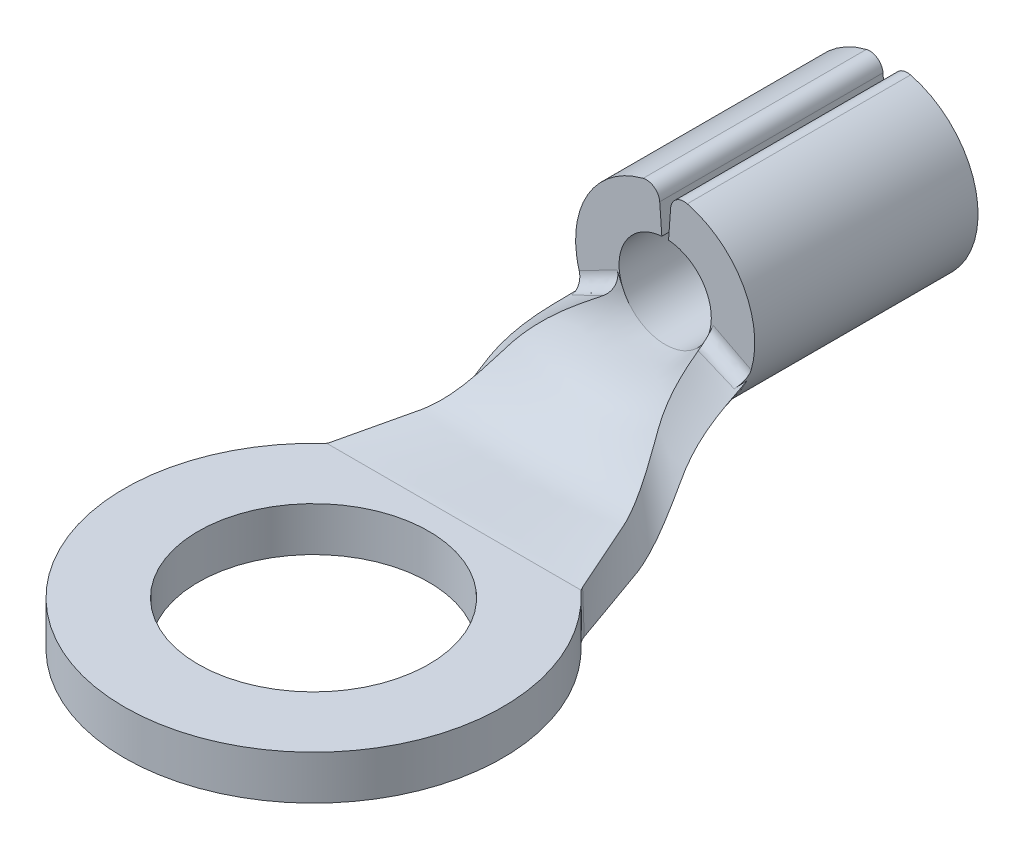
ISO-10303-21;
HEADER;
FILE_DESCRIPTION(('STEP AP214'),'2;1');
FILE_NAME('part.step','',(''),(''),'','','');
FILE_SCHEMA(('AUTOMOTIVE_DESIGN { 1 0 10303 214 1 1 1 1 }'));
ENDSEC;
DATA;
#1=APPLICATION_CONTEXT('core data for automotive mechanical design processes');
#2=APPLICATION_PROTOCOL_DEFINITION('international standard','automotive_design',2000,#1);
#3=PRODUCT_CONTEXT('',#1,'mechanical');
#4=PRODUCT('Part','Part','',(#3));
#5=PRODUCT_RELATED_PRODUCT_CATEGORY('part','',(#4));
#6=PRODUCT_DEFINITION_FORMATION('','',#4);
#7=PRODUCT_DEFINITION_CONTEXT('part definition',#1,'design');
#8=PRODUCT_DEFINITION('design','',#6,#7);
#9=PRODUCT_DEFINITION_SHAPE('','',#8);
#10=(LENGTH_UNIT() NAMED_UNIT(*) SI_UNIT(.MILLI.,.METRE.));
#11=(NAMED_UNIT(*) PLANE_ANGLE_UNIT() SI_UNIT($,.RADIAN.));
#12=(NAMED_UNIT(*) SI_UNIT($,.STERADIAN.) SOLID_ANGLE_UNIT());
#13=UNCERTAINTY_MEASURE_WITH_UNIT(LENGTH_MEASURE(1.E-05),#10,'distance_accuracy_value','');
#14=(GEOMETRIC_REPRESENTATION_CONTEXT(3) GLOBAL_UNCERTAINTY_ASSIGNED_CONTEXT((#13)) GLOBAL_UNIT_ASSIGNED_CONTEXT((#10,
#11,#12)) REPRESENTATION_CONTEXT('',''));
#15=CARTESIAN_POINT('',(0.,0.,0.));
#16=DIRECTION('',(0.,0.,1.));
#17=DIRECTION('',(1.,0.,0.));
#18=AXIS2_PLACEMENT_3D('',#15,#16,#17);
#19=CARTESIAN_POINT('',(0.,0.,4.2418));
#20=DIRECTION('',(0.,0.,1.));
#21=DIRECTION('',(1.,0.,0.));
#22=AXIS2_PLACEMENT_3D('',#19,#20,#21);
#23=PLANE('',#22);
#24=CARTESIAN_POINT('',(-0.1239239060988,1.69728197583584,4.2418));
#25=CARTESIAN_POINT('',(-0.287449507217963,1.68523618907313,4.2418));
#26=CARTESIAN_POINT('',(-0.445188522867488,1.64253779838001,4.2418));
#27=CARTESIAN_POINT('',(-0.602670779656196,1.59990890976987,4.2418));
#28=CARTESIAN_POINT('',(-0.750126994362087,1.52755776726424,4.2418));
#29=CARTESIAN_POINT('',(-0.89659567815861,1.45569116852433,4.2418));
#30=CARTESIAN_POINT('',(-1.0275564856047,1.35655847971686,4.2418));
#31=CARTESIAN_POINT('',(-1.15764023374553,1.2580896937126,4.2418));
#32=CARTESIAN_POINT('',(-1.26730298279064,1.13581089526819,4.2418));
#33=CARTESIAN_POINT('',(-1.37623130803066,1.01435101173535,4.2418));
#34=CARTESIAN_POINT('',(-1.46057439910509,0.873410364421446,4.2418));
#35=CARTESIAN_POINT('',(-1.54435263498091,0.733413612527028,4.2418));
#36=CARTESIAN_POINT('',(-1.60028300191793,0.578979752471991,4.2418));
#37=CARTESIAN_POINT('',(-1.65583879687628,0.425580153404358,4.2418));
#38=CARTESIAN_POINT('',(-1.6813053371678,0.263316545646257,4.2418));
#39=CARTESIAN_POINT('',(-1.70660132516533,0.102139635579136,4.2418));
#40=CARTESIAN_POINT('',(-1.7006701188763,-0.0620031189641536,4.2418));
#41=CARTESIAN_POINT('',(-1.69477863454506,-0.225046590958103,4.2418));
#42=CARTESIAN_POINT('',(-1.6576671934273,-0.38504897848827,4.2418));
#43=CARTESIAN_POINT('',(-1.62080429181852,-0.543979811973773,4.2418));
#44=CARTESIAN_POINT('',(-1.55387358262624,-0.693974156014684,4.2418));
#45=CARTESIAN_POINT('',(-1.48739111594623,-0.842963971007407,4.2418));
#46=CARTESIAN_POINT('',(-1.39309565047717,-0.977449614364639,4.2418));
#47=CARTESIAN_POINT('',(-1.29943169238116,-1.11103459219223,4.2418));
#48=CARTESIAN_POINT('',(-1.18122951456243,-1.22507961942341,4.2418));
#49=CARTESIAN_POINT('',(-1.06381895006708,-1.3383608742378,4.2418));
#50=CARTESIAN_POINT('',(-0.926044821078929,-1.42778297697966,4.2418));
#51=CARTESIAN_POINT('',(-0.789193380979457,-1.51660620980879,4.2418));
#52=CARTESIAN_POINT('',(-0.636899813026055,-1.57812606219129,4.2418));
#53=CARTESIAN_POINT('',(-0.485626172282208,-1.63923390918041,4.2418));
#54=CARTESIAN_POINT('',(-0.324398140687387,-1.67059542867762,4.2418));
#55=CARTESIAN_POINT('',(-0.16424987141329,-1.7017469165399,4.2418));
#56=CARTESIAN_POINT('',(0.,-1.7018,4.2418));
#57=CARTESIAN_POINT('',(0.163149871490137,-1.70185272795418,4.2418));
#58=CARTESIAN_POINT('',(0.324398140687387,-1.67059542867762,4.2418));
#59=CARTESIAN_POINT('',(0.484566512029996,-1.6395474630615,4.2418));
#60=CARTESIAN_POINT('',(0.636899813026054,-1.57812606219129,4.2418));
#61=CARTESIAN_POINT('',(0.788212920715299,-1.51711600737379,4.2418));
#62=CARTESIAN_POINT('',(0.926044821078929,-1.42778297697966,4.2418));
#63=CARTESIAN_POINT('',(1.06295364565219,-1.33904821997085,4.2418));
#64=CARTESIAN_POINT('',(1.18122951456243,-1.22507961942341,4.2418));
#65=CARTESIAN_POINT('',(1.29871327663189,-1.11187427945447,4.2418));
#66=CARTESIAN_POINT('',(1.39309565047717,-0.97744961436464,4.2418));
#67=CARTESIAN_POINT('',(1.48684593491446,-0.843925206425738,4.2418));
#68=CARTESIAN_POINT('',(1.55387358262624,-0.693974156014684,4.2418));
#69=CARTESIAN_POINT('',(1.62045233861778,-0.54502734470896,4.2418));
#70=CARTESIAN_POINT('',(1.6576671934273,-0.38504897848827,4.2418));
#71=CARTESIAN_POINT('',(1.69463281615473,-0.226142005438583,4.2418));
#72=CARTESIAN_POINT('',(1.7006701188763,-0.062003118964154,4.2418));
#73=CARTESIAN_POINT('',(1.70666698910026,0.101036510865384,4.2418));
#74=CARTESIAN_POINT('',(1.6813053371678,0.263316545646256,4.2418));
#75=CARTESIAN_POINT('',(1.65611353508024,0.424509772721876,4.2418));
#76=CARTESIAN_POINT('',(1.60028300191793,0.578979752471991,4.2418));
#77=CARTESIAN_POINT('',(1.54482637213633,0.732415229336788,4.2418));
#78=CARTESIAN_POINT('',(1.46057439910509,0.873410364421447,4.2418));
#79=CARTESIAN_POINT('',(1.37688667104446,1.01346123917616,4.2418));
#80=CARTESIAN_POINT('',(1.26730298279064,1.13581089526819,4.2418));
#81=CARTESIAN_POINT('',(1.15845318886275,1.25734116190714,4.2418));
#82=CARTESIAN_POINT('',(1.0275564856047,1.35655847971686,4.2418));
#83=CARTESIAN_POINT('',(0.897536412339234,1.45511132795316,4.2418));
#84=CARTESIAN_POINT('',(0.750126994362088,1.52755776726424,4.2418));
#85=CARTESIAN_POINT('',(0.603704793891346,1.59951902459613,4.2418));
#86=CARTESIAN_POINT('',(0.445188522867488,1.64253779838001,4.2418));
#87=CARTESIAN_POINT('',(0.288003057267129,1.68519541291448,4.2418));
#88=CARTESIAN_POINT('',(0.123923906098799,1.69728197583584,4.2418));
#89=B_SPLINE_CURVE_WITH_KNOTS('',2,(#24,#25,#26,#27,#28,#29,#30,#31,#32,#33,#34,#35,#36,#37,#38,
#39,#40,#41,#42,#43,#44,#45,#46,#47,#48,#49,#50,#51,#52,#53,#54,#55,#56,#57,#58,#59,#60,#61,#62,
#63,#64,#65,#66,#67,#68,#69,#70,#71,#72,#73,#74,#75,#76,#77,#78,#79,#80,#81,#82,#83,#84,#85,#86,
#87,#88),.UNSPECIFIED.,.F.,.F.,(3,2,2,2,2,2,2,2,2,2,2,2,2,2,2,2,2,2,2,2,2,2,2,2,2,2,2,2,2,2,2,2,
3),(0.,0.03125,0.0625,0.09375,0.125,0.15625,0.1875,0.21875,0.25,0.28125,0.3125,0.34375,0.375,
0.40625,0.4375,0.46875,0.5,0.53125,0.5625,0.59375,0.625,0.65625,0.6875,0.71875,0.75,0.78125,
0.8125,0.84375,0.875,0.90625,0.9375,0.96875,1.),.UNSPECIFIED.);
#90=CARTESIAN_POINT('',(1.63356853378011,-0.477055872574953,4.2418));
#91=VERTEX_POINT('',#90);
#92=CARTESIAN_POINT('',(0.419771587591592,1.64922036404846,4.2418));
#93=VERTEX_POINT('',#92);
#94=EDGE_CURVE('E628',#91,#93,#89,.T.);
#95=ORIENTED_EDGE('',*,*,#94,.T.);
#96=CARTESIAN_POINT('',(0.35711832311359,1.403064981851,4.2418));
#97=DIRECTION('',(0.,0.,1.));
#98=DIRECTION('',(1.,0.,0.));
#99=AXIS2_PLACEMENT_3D('',#96,#97,#98);
#100=CIRCLE('',#99,0.254);
#101=CARTESIAN_POINT('',(0.10379265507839,1.42156108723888,4.2418));
#102=VERTEX_POINT('',#101);
#103=EDGE_CURVE('E596',#93,#102,#100,.T.);
#104=ORIENTED_EDGE('',*,*,#103,.T.);
#105=DIRECTION('',(-0.0728193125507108,-0.997345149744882,0.));
#106=VECTOR('',#105,1.);
#107=CARTESIAN_POINT('',(0.0638115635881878,0.87397355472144,4.2418));
#108=LINE('',#107,#106);
#109=CARTESIAN_POINT('',(0.0638115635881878,0.87397355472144,4.2418));
#110=VERTEX_POINT('',#109);
#111=EDGE_CURVE('E534',#102,#110,#108,.T.);
#112=ORIENTED_EDGE('',*,*,#111,.T.);
#113=CARTESIAN_POINT('',(0.0638115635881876,0.87397355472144,4.2418));
#114=CARTESIAN_POINT('',(0.233749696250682,0.861351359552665,4.2418));
#115=CARTESIAN_POINT('',(0.38625942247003,0.786578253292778,4.2418));
#116=CARTESIAN_POINT('',(0.538551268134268,0.711911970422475,4.2418));
#117=CARTESIAN_POINT('',(0.652566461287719,0.584857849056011,4.2418));
#118=CARTESIAN_POINT('',(0.765846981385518,0.458622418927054,4.2418));
#119=CARTESIAN_POINT('',(0.824026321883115,0.298131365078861,4.2418));
#120=CARTESIAN_POINT('',(0.881830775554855,0.138674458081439,4.2418));
#121=CARTESIAN_POINT('',(0.875718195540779,-0.0319269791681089,4.2418));
#122=CARTESIAN_POINT('',(0.869645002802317,-0.201429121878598,4.2418));
#123=CARTESIAN_POINT('',(0.800128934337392,-0.357344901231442,4.2418));
#124=CARTESIAN_POINT('',(0.731060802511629,-0.512256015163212,4.2418));
#125=CARTESIAN_POINT('',(0.608245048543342,-0.630824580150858,4.2418));
#126=CARTESIAN_POINT('',(0.486220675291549,-0.748629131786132,4.2418));
#127=CARTESIAN_POINT('',(0.327955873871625,-0.812617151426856,4.2418));
#128=CARTESIAN_POINT('',(0.170710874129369,-0.876192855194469,4.2418));
#129=CARTESIAN_POINT('',(0.,-0.876299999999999,4.2418));
#130=CARTESIAN_POINT('',(-0.16961087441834,-0.87640645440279,4.2418));
#131=CARTESIAN_POINT('',(-0.327955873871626,-0.812617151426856,4.2418));
#132=CARTESIAN_POINT('',(-0.485280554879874,-0.74923888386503,4.2418));
#133=CARTESIAN_POINT('',(-0.608245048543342,-0.630824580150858,4.2418));
#134=CARTESIAN_POINT('',(-0.730417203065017,-0.513173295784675,4.2418));
#135=CARTESIAN_POINT('',(-0.800128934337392,-0.357344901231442,4.2418));
#136=CARTESIAN_POINT('',(-0.869391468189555,-0.202520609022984,4.2418));
#137=CARTESIAN_POINT('',(-0.875718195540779,-0.0319269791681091,4.2418));
#138=CARTESIAN_POINT('',(-0.882004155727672,0.137567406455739,4.2418));
#139=CARTESIAN_POINT('',(-0.824026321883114,0.298131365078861,4.2418));
#140=CARTESIAN_POINT('',(-0.766422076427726,0.45766070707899,4.2418));
#141=CARTESIAN_POINT('',(-0.652566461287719,0.58485784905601,4.2418));
#142=CARTESIAN_POINT('',(-0.539444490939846,0.711235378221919,4.2418));
#143=CARTESIAN_POINT('',(-0.386259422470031,0.786578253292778,4.2418));
#144=CARTESIAN_POINT('',(-0.234318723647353,0.861309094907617,4.2418));
#145=CARTESIAN_POINT('',(-0.0638115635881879,0.87397355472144,4.2418));
#146=B_SPLINE_CURVE_WITH_KNOTS('',2,(#113,#114,#115,#116,#117,#118,#119,#120,#121,#122,#123,
#124,#125,#126,#127,#128,#129,#130,#131,#132,#133,#134,#135,#136,#137,#138,#139,#140,#141,#142,
#143,#144,#145),.UNSPECIFIED.,.F.,.F.,(3,2,2,2,2,2,2,2,2,2,2,2,2,2,2,2,3),(0.,0.0625,0.125,
0.1875,0.25,0.3125,0.375,0.4375,0.5,0.5625,0.625,0.6875,0.75,0.8125,0.875,0.9375,1.),.UNSPECIFIED.);
#147=CARTESIAN_POINT('',(0.800271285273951,-0.357025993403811,4.2418));
#148=VERTEX_POINT('',#147);
#149=EDGE_CURVE('E546',#110,#148,#146,.T.);
#150=ORIENTED_EDGE('',*,*,#149,.T.);
#151=CARTESIAN_POINT('',(0.800271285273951,-0.357025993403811,4.2418));
#152=CARTESIAN_POINT('',(0.837954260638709,-0.272559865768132,4.2418));
#153=CARTESIAN_POINT('',(0.875637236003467,-0.188093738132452,4.2418));
#154=CARTESIAN_POINT('',(0.913320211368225,-0.103627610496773,4.2418));
#155=B_SPLINE_CURVE_WITH_KNOTS('',3,(#151,#152,#153,#154),.UNSPECIFIED.,.F.,.F.,(4,4),(0.,
0.277472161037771),.UNSPECIFIED.);
#156=CARTESIAN_POINT('',(0.913320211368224,-0.103627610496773,4.2418));
#157=VERTEX_POINT('',#156);
#158=EDGE_CURVE('E142',#148,#157,#155,.T.);
#159=ORIENTED_EDGE('',*,*,#158,.T.);
#160=CARTESIAN_POINT('',(0.41178551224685,0.162699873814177,4.2418));
#161=CARTESIAN_POINT('',(0.25600673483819,-0.127896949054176,4.24180000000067));
#162=CARTESIAN_POINT('',(0.295751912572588,-0.0537544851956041,4.56060520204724));
#163=CARTESIAN_POINT('',(0.484007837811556,0.12398327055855,4.2418));
#164=CARTESIAN_POINT('',(0.330665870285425,-0.160663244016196,4.24180000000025));
#165=CARTESIAN_POINT('',(0.367630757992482,-0.0936852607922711,4.55594303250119));
#166=CARTESIAN_POINT('',(0.556294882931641,0.0853873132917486,4.2418));
#167=CARTESIAN_POINT('',(0.406275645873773,-0.193862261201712,4.24180000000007));
#168=CARTESIAN_POINT('',(0.439639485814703,-0.133394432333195,4.55117949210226));
#169=CARTESIAN_POINT('',(0.70100000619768,0.00844331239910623,4.2418));
#170=CARTESIAN_POINT('',(0.557432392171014,-0.260268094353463,4.24179999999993));
#171=CARTESIAN_POINT('',(0.583924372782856,-0.212339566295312,4.54149843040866));
#172=CARTESIAN_POINT('',(0.773418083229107,-0.0299047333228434,4.2418));
#173=CARTESIAN_POINT('',(0.632987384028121,-0.293477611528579,4.24179999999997));
#174=CARTESIAN_POINT('',(0.65620052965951,-0.25157553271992,4.53658091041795));
#175=CARTESIAN_POINT('',(0.904717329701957,-0.0991383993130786,4.2418));
#176=CARTESIAN_POINT('',(0.770070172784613,-0.353765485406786,4.24180000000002));
#177=CARTESIAN_POINT('',(0.787371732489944,-0.322192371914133,4.52757794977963));
#178=CARTESIAN_POINT('',(0.963575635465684,-0.130067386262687,4.2418));
#179=CARTESIAN_POINT('',(0.831331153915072,-0.380719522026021,4.24180000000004));
#180=CARTESIAN_POINT('',(0.846219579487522,-0.353659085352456,4.52351049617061));
#181=CARTESIAN_POINT('',(1.02247859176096,-0.160911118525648,4.2418));
#182=CARTESIAN_POINT('',(0.893131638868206,-0.40792406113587,4.2418));
#183=CARTESIAN_POINT('',(0.905160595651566,-0.384952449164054,4.51942139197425));
#184=CARTESIAN_POINT('',(1.03617328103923,-0.168082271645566,4.2418));
#185=CARTESIAN_POINT('',(0.907340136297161,-0.41417862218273,4.2418));
#186=CARTESIAN_POINT('',(0.918863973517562,-0.39222838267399,4.51847089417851));
#187=CARTESIAN_POINT('',(1.04987036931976,-0.175248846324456,4.2418));
#188=CARTESIAN_POINT('',(0.921577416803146,-0.420446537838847,4.2418));
#189=CARTESIAN_POINT('',(0.932572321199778,-0.399495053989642,4.51751929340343));
#190=CARTESIAN_POINT('',(1.13619358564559,-0.220378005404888,4.2418));
#191=CARTESIAN_POINT('',(1.01050379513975,-0.459600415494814,4.2418));
#192=CARTESIAN_POINT('',(1.01898261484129,-0.44522525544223,4.51151733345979));
#193=CARTESIAN_POINT('',(1.20888467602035,-0.258216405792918,4.2418));
#194=CARTESIAN_POINT('',(1.08597598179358,-0.492849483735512,4.2418));
#195=CARTESIAN_POINT('',(1.09181889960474,-0.483436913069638,4.50644232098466));
#196=CARTESIAN_POINT('',(1.38451114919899,-0.34924014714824,4.2418));
#197=CARTESIAN_POINT('',(1.2672852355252,-0.572773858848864,4.2418));
#198=CARTESIAN_POINT('',(1.26796551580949,-0.575032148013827,4.49419988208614));
#199=CARTESIAN_POINT('',(1.48751350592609,-0.402296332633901,4.2418));
#200=CARTESIAN_POINT('',(1.37396531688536,-0.619839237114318,4.2418));
#201=CARTESIAN_POINT('',(1.37141303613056,-0.628150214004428,4.48703569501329));
#202=CARTESIAN_POINT('',(1.63209691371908,-0.476320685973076,4.2418));
#203=CARTESIAN_POINT('',(1.52448820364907,-0.686304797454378,4.2418));
#204=CARTESIAN_POINT('',(1.51679797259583,-0.701889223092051,4.47711043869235));
#205=CARTESIAN_POINT('',(1.6735689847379,-0.497501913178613,4.2418));
#206=CARTESIAN_POINT('',(1.56729950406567,-0.705215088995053,4.2418));
#207=CARTESIAN_POINT('',(1.55852028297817,-0.722945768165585,4.47427857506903));
#208=CARTESIAN_POINT('',(1.71506178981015,-0.518642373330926,4.2418));
#209=CARTESIAN_POINT('',(1.61031790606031,-0.72422336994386,4.2418));
#210=CARTESIAN_POINT('',(1.60028286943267,-0.743919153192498,4.47146541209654));
#211=CARTESIAN_POINT('',(1.74593357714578,-0.534371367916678,4.2418));
#212=CARTESIAN_POINT('',(1.64204892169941,-0.73824407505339,4.2418));
#213=CARTESIAN_POINT('',(1.6313555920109,-0.759523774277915,4.46937097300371));
#214=CARTESIAN_POINT('',(1.77681661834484,-0.55007819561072,4.2418));
#215=CARTESIAN_POINT('',(1.67388588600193,-0.752315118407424,4.2418));
#216=CARTESIAN_POINT('',(1.66244964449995,-0.775083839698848,4.4672884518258));
#217=CARTESIAN_POINT('',(1.83860520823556,-0.581447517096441,4.2418));
#218=CARTESIAN_POINT('',(1.73754554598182,-0.780457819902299,4.2418));
#219=CARTESIAN_POINT('',(1.72468040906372,-0.806114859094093,4.46314724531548));
#220=CARTESIAN_POINT('',(1.86951075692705,-0.597110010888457,4.2418));
#221=CARTESIAN_POINT('',(1.76937350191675,-0.79453175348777,4.2418));
#222=CARTESIAN_POINT('',(1.75581712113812,-0.82158581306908,4.46108855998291));
#223=CARTESIAN_POINT('',(1.9004275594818,-0.612750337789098,4.2418));
#224=CARTESIAN_POINT('',(1.80131803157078,-0.808660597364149,4.2418));
#225=CARTESIAN_POINT('',(1.78697516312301,-0.837012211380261,4.45904179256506));
#226=(BOUNDED_SURFACE() B_SPLINE_SURFACE(3,2,((#160,#161,#162),(#163,#164,#165),(#166,#167,
#168),(#169,#170,#171),(#172,#173,#174),(#175,#176,#177),(#178,#179,#180),(#181,#182,#183),
(#184,#185,#186),(#187,#188,#189),(#190,#191,#192),(#193,#194,#195),(#196,#197,#198),(#199,#200,
#201),(#202,#203,#204),(#205,#206,#207),(#208,#209,#210),(#211,#212,#213),(#214,#215,#216),
(#217,#218,#219),(#220,#221,#222),(#223,#224,#225)),.UNSPECIFIED.,.F.,.F.,
.F.) B_SPLINE_SURFACE_WITH_KNOTS((4,2,2,3,2,2,2,3,2,4),(3,3),(0.,0.245835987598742,
0.49166989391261,0.691139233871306,0.737515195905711,0.983363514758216,1.33095362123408,
1.47065746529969,1.57460071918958,1.67854397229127),(0.,1.),
.UNSPECIFIED.) GEOMETRIC_REPRESENTATION_ITEM() RATIONAL_B_SPLINE_SURFACE(((1.,0.610271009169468,
1.),(1.,0.61779256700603,1.),(1.,0.625334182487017,1.),(1.,0.64038909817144,1.),(1.,
0.647902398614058,1.),(1.,0.66142447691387,1.),(1.,0.66744975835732,1.),(1.,0.673424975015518,
1.),(1.,0.674814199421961,1.),(1.,0.676200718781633,1.),(1.,0.684919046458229,1.),(1.,
0.692171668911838,1.),(1.,0.709402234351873,1.),(1.,0.719265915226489,1.),(1.,0.732670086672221,
1.),(1.,0.736464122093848,1.),(1.,0.74020452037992,1.),(1.,0.74298882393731,1.),(1.,
0.745742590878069,1.),(1.,0.751189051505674,1.),(1.,0.753881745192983,1.),(1.,0.756543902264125,1.))) REPRESENTATION_ITEM('') SURFACE());
#227=CARTESIAN_POINT('',(0.41178551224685,0.162699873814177,4.2418));
#228=CARTESIAN_POINT('',(0.484007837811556,0.12398327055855,4.2418));
#229=CARTESIAN_POINT('',(0.556294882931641,0.0853873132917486,4.2418));
#230=CARTESIAN_POINT('',(0.70100000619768,0.00844331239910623,4.2418));
#231=CARTESIAN_POINT('',(0.773418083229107,-0.0299047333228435,4.2418));
#232=CARTESIAN_POINT('',(0.904717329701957,-0.0991383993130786,4.2418));
#233=CARTESIAN_POINT('',(0.963575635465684,-0.130067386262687,4.2418));
#234=CARTESIAN_POINT('',(1.02247859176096,-0.160911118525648,4.2418));
#235=CARTESIAN_POINT('',(1.03617328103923,-0.168082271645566,4.2418));
#236=CARTESIAN_POINT('',(1.04987036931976,-0.175248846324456,4.2418));
#237=CARTESIAN_POINT('',(1.13619358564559,-0.220378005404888,4.2418));
#238=CARTESIAN_POINT('',(1.20888467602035,-0.258216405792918,4.2418));
#239=CARTESIAN_POINT('',(1.38451114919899,-0.34924014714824,4.2418));
#240=CARTESIAN_POINT('',(1.48751350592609,-0.402296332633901,4.2418));
#241=CARTESIAN_POINT('',(1.63209691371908,-0.476320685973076,4.2418));
#242=CARTESIAN_POINT('',(1.6735689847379,-0.497501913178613,4.2418));
#243=CARTESIAN_POINT('',(1.71506178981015,-0.518642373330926,4.2418));
#244=CARTESIAN_POINT('',(1.74593357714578,-0.534371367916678,4.2418));
#245=CARTESIAN_POINT('',(1.77681661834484,-0.55007819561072,4.2418));
#246=CARTESIAN_POINT('',(1.83860520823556,-0.581447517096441,4.2418));
#247=CARTESIAN_POINT('',(1.86951075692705,-0.597110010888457,4.2418));
#248=CARTESIAN_POINT('',(1.9004275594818,-0.612750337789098,4.2418));
#249=B_SPLINE_CURVE_WITH_KNOTS('',3,(#227,#228,#229,#230,#231,#232,#233,#234,#235,#236,#237,
#238,#239,#240,#241,#242,#243,#244,#245,#246,#247,#248),.UNSPECIFIED.,.F.,.F.,(4,2,2,3,2,2,2,3,
2,4),(0.,0.245835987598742,0.49166989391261,0.691139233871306,0.737515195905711,
0.983363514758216,1.33095362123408,1.47065746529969,1.57460071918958,1.67854397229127),.UNSPECIFIED.);
#250=EDGE_CURVE('E478',#157,#91,#249,.T.);
#251=ORIENTED_EDGE('',*,*,#250,.T.);
#252=EDGE_LOOP('',(#95,#104,#112,#150,#159,#251));
#253=FACE_BOUND('',#252,.T.);
#254=ADVANCED_FACE('F114',(#253),#23,.T.);
#255=DIRECTION('',(-0.0728193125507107,0.997345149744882,0.));
#256=VECTOR('',#255,1.);
#257=CARTESIAN_POINT('',(-0.0638115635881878,0.87397355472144,4.2418));
#258=LINE('',#257,#256);
#259=CARTESIAN_POINT('',(-0.0638115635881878,0.87397355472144,4.2418));
#260=VERTEX_POINT('',#259);
#261=CARTESIAN_POINT('',(-0.10379265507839,1.42156108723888,4.2418));
#262=VERTEX_POINT('',#261);
#263=EDGE_CURVE('E554',#260,#262,#258,.T.);
#264=ORIENTED_EDGE('',*,*,#263,.T.);
#265=CARTESIAN_POINT('',(-0.35711832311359,1.403064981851,4.2418));
#266=DIRECTION('',(0.,0.,1.));
#267=DIRECTION('',(1.,0.,0.));
#268=AXIS2_PLACEMENT_3D('',#265,#266,#267);
#269=CIRCLE('',#268,0.254);
#270=CARTESIAN_POINT('',(-0.419769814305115,1.64921339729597,4.2418));
#271=VERTEX_POINT('',#270);
#272=EDGE_CURVE('E495',#262,#271,#269,.T.);
#273=ORIENTED_EDGE('',*,*,#272,.T.);
#274=CARTESIAN_POINT('',(-0.1239239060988,1.69728197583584,4.2418));
#275=CARTESIAN_POINT('',(-0.287449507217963,1.68523618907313,4.2418));
#276=CARTESIAN_POINT('',(-0.445188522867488,1.64253779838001,4.2418));
#277=CARTESIAN_POINT('',(-0.602670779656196,1.59990890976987,4.2418));
#278=CARTESIAN_POINT('',(-0.750126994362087,1.52755776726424,4.2418));
#279=CARTESIAN_POINT('',(-0.89659567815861,1.45569116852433,4.2418));
#280=CARTESIAN_POINT('',(-1.0275564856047,1.35655847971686,4.2418));
#281=CARTESIAN_POINT('',(-1.15764023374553,1.2580896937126,4.2418));
#282=CARTESIAN_POINT('',(-1.26730298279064,1.13581089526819,4.2418));
#283=CARTESIAN_POINT('',(-1.37623130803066,1.01435101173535,4.2418));
#284=CARTESIAN_POINT('',(-1.46057439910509,0.873410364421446,4.2418));
#285=CARTESIAN_POINT('',(-1.54435263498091,0.733413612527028,4.2418));
#286=CARTESIAN_POINT('',(-1.60028300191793,0.578979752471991,4.2418));
#287=CARTESIAN_POINT('',(-1.65583879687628,0.425580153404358,4.2418));
#288=CARTESIAN_POINT('',(-1.6813053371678,0.263316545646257,4.2418));
#289=CARTESIAN_POINT('',(-1.70660132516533,0.102139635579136,4.2418));
#290=CARTESIAN_POINT('',(-1.7006701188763,-0.0620031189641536,4.2418));
#291=CARTESIAN_POINT('',(-1.69477863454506,-0.225046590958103,4.2418));
#292=CARTESIAN_POINT('',(-1.6576671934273,-0.38504897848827,4.2418));
#293=CARTESIAN_POINT('',(-1.62080429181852,-0.543979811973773,4.2418));
#294=CARTESIAN_POINT('',(-1.55387358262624,-0.693974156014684,4.2418));
#295=CARTESIAN_POINT('',(-1.48739111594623,-0.842963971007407,4.2418));
#296=CARTESIAN_POINT('',(-1.39309565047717,-0.977449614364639,4.2418));
#297=CARTESIAN_POINT('',(-1.29943169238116,-1.11103459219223,4.2418));
#298=CARTESIAN_POINT('',(-1.18122951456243,-1.22507961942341,4.2418));
#299=CARTESIAN_POINT('',(-1.06381895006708,-1.3383608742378,4.2418));
#300=CARTESIAN_POINT('',(-0.926044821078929,-1.42778297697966,4.2418));
#301=CARTESIAN_POINT('',(-0.789193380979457,-1.51660620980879,4.2418));
#302=CARTESIAN_POINT('',(-0.636899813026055,-1.57812606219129,4.2418));
#303=CARTESIAN_POINT('',(-0.485626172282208,-1.63923390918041,4.2418));
#304=CARTESIAN_POINT('',(-0.324398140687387,-1.67059542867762,4.2418));
#305=CARTESIAN_POINT('',(-0.16424987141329,-1.7017469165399,4.2418));
#306=CARTESIAN_POINT('',(0.,-1.7018,4.2418));
#307=CARTESIAN_POINT('',(0.163149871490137,-1.70185272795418,4.2418));
#308=CARTESIAN_POINT('',(0.324398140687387,-1.67059542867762,4.2418));
#309=CARTESIAN_POINT('',(0.484566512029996,-1.6395474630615,4.2418));
#310=CARTESIAN_POINT('',(0.636899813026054,-1.57812606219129,4.2418));
#311=CARTESIAN_POINT('',(0.788212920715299,-1.51711600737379,4.2418));
#312=CARTESIAN_POINT('',(0.926044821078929,-1.42778297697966,4.2418));
#313=CARTESIAN_POINT('',(1.06295364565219,-1.33904821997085,4.2418));
#314=CARTESIAN_POINT('',(1.18122951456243,-1.22507961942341,4.2418));
#315=CARTESIAN_POINT('',(1.29871327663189,-1.11187427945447,4.2418));
#316=CARTESIAN_POINT('',(1.39309565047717,-0.97744961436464,4.2418));
#317=CARTESIAN_POINT('',(1.48684593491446,-0.843925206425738,4.2418));
#318=CARTESIAN_POINT('',(1.55387358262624,-0.693974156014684,4.2418));
#319=CARTESIAN_POINT('',(1.62045233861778,-0.54502734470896,4.2418));
#320=CARTESIAN_POINT('',(1.6576671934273,-0.38504897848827,4.2418));
#321=CARTESIAN_POINT('',(1.69463281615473,-0.226142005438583,4.2418));
#322=CARTESIAN_POINT('',(1.7006701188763,-0.062003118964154,4.2418));
#323=CARTESIAN_POINT('',(1.70666698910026,0.101036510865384,4.2418));
#324=CARTESIAN_POINT('',(1.6813053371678,0.263316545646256,4.2418));
#325=CARTESIAN_POINT('',(1.65611353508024,0.424509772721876,4.2418));
#326=CARTESIAN_POINT('',(1.60028300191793,0.578979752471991,4.2418));
#327=CARTESIAN_POINT('',(1.54482637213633,0.732415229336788,4.2418));
#328=CARTESIAN_POINT('',(1.46057439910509,0.873410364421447,4.2418));
#329=CARTESIAN_POINT('',(1.37688667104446,1.01346123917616,4.2418));
#330=CARTESIAN_POINT('',(1.26730298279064,1.13581089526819,4.2418));
#331=CARTESIAN_POINT('',(1.15845318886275,1.25734116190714,4.2418));
#332=CARTESIAN_POINT('',(1.0275564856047,1.35655847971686,4.2418));
#333=CARTESIAN_POINT('',(0.897536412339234,1.45511132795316,4.2418));
#334=CARTESIAN_POINT('',(0.750126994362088,1.52755776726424,4.2418));
#335=CARTESIAN_POINT('',(0.603704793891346,1.59951902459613,4.2418));
#336=CARTESIAN_POINT('',(0.445188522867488,1.64253779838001,4.2418));
#337=CARTESIAN_POINT('',(0.288003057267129,1.68519541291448,4.2418));
#338=CARTESIAN_POINT('',(0.123923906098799,1.69728197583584,4.2418));
#339=B_SPLINE_CURVE_WITH_KNOTS('',2,(#274,#275,#276,#277,#278,#279,#280,#281,#282,#283,#284,
#285,#286,#287,#288,#289,#290,#291,#292,#293,#294,#295,#296,#297,#298,#299,#300,#301,#302,#303,
#304,#305,#306,#307,#308,#309,#310,#311,#312,#313,#314,#315,#316,#317,#318,#319,#320,#321,#322,
#323,#324,#325,#326,#327,#328,#329,#330,#331,#332,#333,#334,#335,#336,#337,#338),.UNSPECIFIED.,
.F.,.F.,(3,2,2,2,2,2,2,2,2,2,2,2,2,2,2,2,2,2,2,2,2,2,2,2,2,2,2,2,2,2,2,2,3),(0.,0.03125,0.0625,
0.09375,0.125,0.15625,0.1875,0.21875,0.25,0.28125,0.3125,0.34375,0.375,0.40625,0.4375,0.46875,
0.5,0.53125,0.5625,0.59375,0.625,0.65625,0.6875,0.71875,0.75,0.78125,0.8125,0.84375,0.875,
0.90625,0.9375,0.96875,1.),.UNSPECIFIED.);
#340=CARTESIAN_POINT('',(-1.63357634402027,-0.477061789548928,4.2418));
#341=VERTEX_POINT('',#340);
#342=EDGE_CURVE('E538',#271,#341,#339,.T.);
#343=ORIENTED_EDGE('',*,*,#342,.T.);
#344=CARTESIAN_POINT('',(-1.90043669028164,-0.61275495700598,4.2418));
#345=CARTESIAN_POINT('',(-1.80132743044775,-0.808664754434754,4.2418));
#346=CARTESIAN_POINT('',(-1.78698436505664,-0.837016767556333,4.45904118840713));
#347=CARTESIAN_POINT('',(-1.86951836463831,-0.597113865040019,4.2418));
#348=CARTESIAN_POINT('',(-1.76938132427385,-0.794535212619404,4.2418));
#349=CARTESIAN_POINT('',(-1.75582478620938,-0.821589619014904,4.46108805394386));
#350=CARTESIAN_POINT('',(-1.83861129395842,-0.581450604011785,4.2418));
#351=CARTESIAN_POINT('',(-1.73755180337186,-0.780460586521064,4.2418));
#352=CARTESIAN_POINT('',(-1.72468653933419,-0.806117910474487,4.46314683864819));
#353=CARTESIAN_POINT('',(-1.77681966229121,-0.550079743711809,4.2418));
#354=CARTESIAN_POINT('',(-1.67388901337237,-0.752316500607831,4.2418));
#355=CARTESIAN_POINT('',(-1.66245270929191,-0.775085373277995,4.46728824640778));
#356=CARTESIAN_POINT('',(-1.74593510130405,-0.53437214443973,4.2418));
#357=CARTESIAN_POINT('',(-1.64205048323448,-0.738244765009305,4.2418));
#358=CARTESIAN_POINT('',(-1.63135712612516,-0.759524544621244,4.46937086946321));
#359=CARTESIAN_POINT('',(-1.71506179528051,-0.518642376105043,4.2418));
#360=CARTESIAN_POINT('',(-1.61031791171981,-0.724223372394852,4.2418));
#361=CARTESIAN_POINT('',(-1.6002828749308,-0.74391915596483,4.47146541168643));
#362=CARTESIAN_POINT('',(-1.67357169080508,-0.497503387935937,4.2418));
#363=CARTESIAN_POINT('',(-1.567300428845,-0.705215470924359,4.2418));
#364=CARTESIAN_POINT('',(-1.5585228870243,-0.722947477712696,4.47427834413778));
#365=CARTESIAN_POINT('',(-1.63210237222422,-0.476323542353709,4.2418));
#366=CARTESIAN_POINT('',(-1.52449251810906,-0.686306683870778,4.2418));
#367=CARTESIAN_POINT('',(-1.51680337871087,-0.701892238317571,4.47711003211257));
#368=CARTESIAN_POINT('',(-1.48751905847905,-0.402299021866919,4.2418));
#369=CARTESIAN_POINT('',(-1.3739743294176,-0.619843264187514,4.2418));
#370=CARTESIAN_POINT('',(-1.37141882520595,-0.628152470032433,4.48703539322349));
#371=CARTESIAN_POINT('',(-1.38451414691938,-0.349241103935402,4.2418));
#372=CARTESIAN_POINT('',(-1.26729986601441,-0.572780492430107,4.2418));
#373=CARTESIAN_POINT('',(-1.2679692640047,-0.575031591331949,4.49419996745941));
#374=CARTESIAN_POINT('',(-1.19515964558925,-0.251103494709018,4.2418));
#375=CARTESIAN_POINT('',(-1.07141613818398,-0.486431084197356,4.2418));
#376=CARTESIAN_POINT('',(-1.07805259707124,-0.47628062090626,4.50739880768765));
#377=CARTESIAN_POINT('',(-1.10877088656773,-0.206099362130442,4.2418));
#378=CARTESIAN_POINT('',(-0.981661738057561,-0.446894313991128,4.2418));
#379=CARTESIAN_POINT('',(-0.991505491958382,-0.430805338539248,4.51343131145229));
#380=CARTESIAN_POINT('',(-1.02247860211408,-0.160911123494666,4.2418));
#381=CARTESIAN_POINT('',(-0.893131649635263,-0.407924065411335,4.2418));
#382=CARTESIAN_POINT('',(-0.905160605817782,-0.384952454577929,4.51942139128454));
#383=CARTESIAN_POINT('',(-1.00612913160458,-0.152349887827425,4.2418));
#384=CARTESIAN_POINT('',(-0.876089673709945,-0.400422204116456,4.2418));
#385=CARTESIAN_POINT('',(-0.888800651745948,-0.376266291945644,4.52055629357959));
#386=CARTESIAN_POINT('',(-0.989783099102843,-0.143782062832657,4.2418));
#387=CARTESIAN_POINT('',(-0.859090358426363,-0.392940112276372,4.2418));
#388=CARTESIAN_POINT('',(-0.872447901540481,-0.367566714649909,4.52168948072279));
#389=CARTESIAN_POINT('',(-0.768235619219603,-0.0275441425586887,4.2418));
#390=CARTESIAN_POINT('',(-0.621794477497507,-0.288510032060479,4.2418));
#391=CARTESIAN_POINT('',(-0.650859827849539,-0.249452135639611,4.53702460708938));
#392=CARTESIAN_POINT('',(-0.56357062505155,0.0811518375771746,4.2418));
#393=CARTESIAN_POINT('',(-0.407780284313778,-0.194489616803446,4.2418));
#394=CARTESIAN_POINT('',(-0.44674426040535,-0.137964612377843,4.55091626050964));
#395=CARTESIAN_POINT('',(-0.257336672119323,0.245625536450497,4.2418));
#396=CARTESIAN_POINT('',(-0.09232495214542,-0.0560738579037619,4.2418));
#397=CARTESIAN_POINT('',(-0.14208855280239,0.0318471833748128,4.57049747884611));
#398=CARTESIAN_POINT('',(-0.155383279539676,0.300689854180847,4.2418));
#399=CARTESIAN_POINT('',(0.0146099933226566,-0.00918477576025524,4.2418));
#400=CARTESIAN_POINT('',(-0.040786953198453,0.0888827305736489,4.576815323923));
#401=CARTESIAN_POINT('',(0.0482833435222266,0.41125958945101,4.2418));
#402=CARTESIAN_POINT('',(0.228669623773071,0.0846261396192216,4.2418));
#403=CARTESIAN_POINT('',(0.161370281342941,0.203679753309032,4.58896535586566));
#404=CARTESIAN_POINT('',(0.149996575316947,0.466765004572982,4.2418));
#405=CARTESIAN_POINT('',(0.335698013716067,0.131503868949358,4.2418));
#406=CARTESIAN_POINT('',(0.262225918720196,0.261441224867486,4.59479754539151));
#407=CARTESIAN_POINT('',(0.251598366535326,0.522473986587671,4.2418));
#408=CARTESIAN_POINT('',(0.440750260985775,0.177497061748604,4.24180000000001));
#409=CARTESIAN_POINT('',(0.362890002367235,0.319499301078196,4.60035356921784));
#410=(BOUNDED_SURFACE() B_SPLINE_SURFACE(3,2,((#344,#345,#346),(#347,#348,#349),(#350,#351,
#352),(#353,#354,#355),(#356,#357,#358),(#359,#360,#361),(#362,#363,#364),(#365,#366,#367),
(#368,#369,#370),(#371,#372,#373),(#374,#375,#376),(#377,#378,#379),(#380,#381,#382),(#383,#384,
#385),(#386,#387,#388),(#389,#390,#391),(#392,#393,#394),(#395,#396,#397),(#398,#399,#400),
(#401,#402,#403),(#404,#405,#406),(#407,#408,#409)),.UNSPECIFIED.,.F.,.F.,
.F.) B_SPLINE_SURFACE_WITH_KNOTS((4,2,3,2,2,3,2,2,2,4),(3,3),(0.,0.103948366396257,
0.2078967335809,0.347591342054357,0.695190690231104,0.987414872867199,1.04278095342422,
1.73798145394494,2.08559994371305,2.43321652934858),(0.,1.),
.UNSPECIFIED.) GEOMETRIC_REPRESENTATION_ITEM() RATIONAL_B_SPLINE_SURFACE(((1.,0.756544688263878,
1.),(1.,0.75388240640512,1.),(1.,0.751189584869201,1.),(1.,0.745742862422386,1.),(1.,
0.742988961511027,1.),(1.,0.740204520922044,1.),(1.,0.73646459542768,1.),(1.,0.732670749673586,
1.),(1.,0.719266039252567,1.),(1.,0.709401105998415,1.),(1.,0.690826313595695,1.),(1.,
0.68218280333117,1.),(1.,0.673424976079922,1.),(1.,0.671766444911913,1.),(1.,0.670104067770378,
1.),(1.,0.647521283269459,1.),(1.,0.626059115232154,1.),(1.,0.594199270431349,1.),(1.,
0.583634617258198,1.),(1.,0.562772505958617,1.),(1.,0.552475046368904,1.),(1.,0.54238905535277,1.))) REPRESENTATION_ITEM('') SURFACE());
#411=CARTESIAN_POINT('',(-1.90043669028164,-0.61275495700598,4.2418));
#412=CARTESIAN_POINT('',(-1.86951836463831,-0.597113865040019,4.2418));
#413=CARTESIAN_POINT('',(-1.83861129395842,-0.581450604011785,4.2418));
#414=CARTESIAN_POINT('',(-1.77681966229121,-0.550079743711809,4.2418));
#415=CARTESIAN_POINT('',(-1.74593510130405,-0.53437214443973,4.2418));
#416=CARTESIAN_POINT('',(-1.71506179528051,-0.518642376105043,4.2418));
#417=CARTESIAN_POINT('',(-1.67357169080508,-0.497503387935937,4.2418));
#418=CARTESIAN_POINT('',(-1.63210237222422,-0.476323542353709,4.2418));
#419=CARTESIAN_POINT('',(-1.48751905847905,-0.402299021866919,4.2418));
#420=CARTESIAN_POINT('',(-1.38451414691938,-0.349241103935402,4.2418));
#421=CARTESIAN_POINT('',(-1.19515964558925,-0.251103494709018,4.2418));
#422=CARTESIAN_POINT('',(-1.10877088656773,-0.206099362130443,4.2418));
#423=CARTESIAN_POINT('',(-1.02247860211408,-0.160911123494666,4.2418));
#424=CARTESIAN_POINT('',(-1.00612913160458,-0.152349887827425,4.2418));
#425=CARTESIAN_POINT('',(-0.989783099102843,-0.143782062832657,4.2418));
#426=CARTESIAN_POINT('',(-0.768235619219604,-0.027544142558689,4.2418));
#427=CARTESIAN_POINT('',(-0.56357062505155,0.0811518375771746,4.2418));
#428=CARTESIAN_POINT('',(-0.257336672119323,0.245625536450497,4.2418));
#429=CARTESIAN_POINT('',(-0.155383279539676,0.300689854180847,4.2418));
#430=CARTESIAN_POINT('',(0.0482833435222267,0.41125958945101,4.2418));
#431=CARTESIAN_POINT('',(0.149996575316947,0.466765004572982,4.2418));
#432=CARTESIAN_POINT('',(0.251598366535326,0.522473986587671,4.2418));
#433=B_SPLINE_CURVE_WITH_KNOTS('',3,(#411,#412,#413,#414,#415,#416,#417,#418,#419,#420,#421,
#422,#423,#424,#425,#426,#427,#428,#429,#430,#431,#432),.UNSPECIFIED.,.F.,.F.,(4,2,3,2,2,3,2,2,
2,4),(0.,0.103948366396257,0.2078967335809,0.347591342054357,0.695190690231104,
0.987414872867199,1.04278095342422,1.73798145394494,2.08559994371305,2.43321652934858),.UNSPECIFIED.);
#434=CARTESIAN_POINT('',(-0.913320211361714,-0.103627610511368,4.2418));
#435=VERTEX_POINT('',#434);
#436=EDGE_CURVE('E494',#341,#435,#433,.T.);
#437=ORIENTED_EDGE('',*,*,#436,.T.);
#438=CARTESIAN_POINT('',(-0.913320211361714,-0.103627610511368,4.2418));
#439=CARTESIAN_POINT('',(-0.875637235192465,-0.188093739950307,4.2418));
#440=CARTESIAN_POINT('',(-0.837954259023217,-0.272559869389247,4.2418));
#441=CARTESIAN_POINT('',(-0.800271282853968,-0.357025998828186,4.2418));
#442=B_SPLINE_CURVE_WITH_KNOTS('',3,(#438,#439,#440,#441),.UNSPECIFIED.,.F.,.F.,(4,4),(0.,
0.277472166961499),.UNSPECIFIED.);
#443=CARTESIAN_POINT('',(-0.80027138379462,-0.357026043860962,4.2418));
#444=VERTEX_POINT('',#443);
#445=EDGE_CURVE('E641',#435,#444,#442,.T.);
#446=ORIENTED_EDGE('',*,*,#445,.T.);
#447=CARTESIAN_POINT('',(0.0638115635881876,0.87397355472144,4.2418));
#448=CARTESIAN_POINT('',(0.233749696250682,0.861351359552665,4.2418));
#449=CARTESIAN_POINT('',(0.38625942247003,0.786578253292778,4.2418));
#450=CARTESIAN_POINT('',(0.538551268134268,0.711911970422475,4.2418));
#451=CARTESIAN_POINT('',(0.652566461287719,0.584857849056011,4.2418));
#452=CARTESIAN_POINT('',(0.765846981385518,0.458622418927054,4.2418));
#453=CARTESIAN_POINT('',(0.824026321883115,0.298131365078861,4.2418));
#454=CARTESIAN_POINT('',(0.881830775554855,0.138674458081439,4.2418));
#455=CARTESIAN_POINT('',(0.875718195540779,-0.0319269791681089,4.2418));
#456=CARTESIAN_POINT('',(0.869645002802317,-0.201429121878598,4.2418));
#457=CARTESIAN_POINT('',(0.800128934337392,-0.357344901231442,4.2418));
#458=CARTESIAN_POINT('',(0.731060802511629,-0.512256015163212,4.2418));
#459=CARTESIAN_POINT('',(0.608245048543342,-0.630824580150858,4.2418));
#460=CARTESIAN_POINT('',(0.486220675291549,-0.748629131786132,4.2418));
#461=CARTESIAN_POINT('',(0.327955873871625,-0.812617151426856,4.2418));
#462=CARTESIAN_POINT('',(0.170710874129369,-0.876192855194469,4.2418));
#463=CARTESIAN_POINT('',(0.,-0.876299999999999,4.2418));
#464=CARTESIAN_POINT('',(-0.16961087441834,-0.87640645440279,4.2418));
#465=CARTESIAN_POINT('',(-0.327955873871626,-0.812617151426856,4.2418));
#466=CARTESIAN_POINT('',(-0.485280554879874,-0.74923888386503,4.2418));
#467=CARTESIAN_POINT('',(-0.608245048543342,-0.630824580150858,4.2418));
#468=CARTESIAN_POINT('',(-0.730417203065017,-0.513173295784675,4.2418));
#469=CARTESIAN_POINT('',(-0.800128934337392,-0.357344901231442,4.2418));
#470=CARTESIAN_POINT('',(-0.869391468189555,-0.202520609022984,4.2418));
#471=CARTESIAN_POINT('',(-0.875718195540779,-0.0319269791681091,4.2418));
#472=CARTESIAN_POINT('',(-0.882004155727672,0.137567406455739,4.2418));
#473=CARTESIAN_POINT('',(-0.824026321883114,0.298131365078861,4.2418));
#474=CARTESIAN_POINT('',(-0.766422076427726,0.45766070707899,4.2418));
#475=CARTESIAN_POINT('',(-0.652566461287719,0.58485784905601,4.2418));
#476=CARTESIAN_POINT('',(-0.539444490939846,0.711235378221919,4.2418));
#477=CARTESIAN_POINT('',(-0.386259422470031,0.786578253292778,4.2418));
#478=CARTESIAN_POINT('',(-0.234318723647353,0.861309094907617,4.2418));
#479=CARTESIAN_POINT('',(-0.0638115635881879,0.87397355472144,4.2418));
#480=B_SPLINE_CURVE_WITH_KNOTS('',2,(#447,#448,#449,#450,#451,#452,#453,#454,#455,#456,#457,
#458,#459,#460,#461,#462,#463,#464,#465,#466,#467,#468,#469,#470,#471,#472,#473,#474,#475,#476,
#477,#478,#479),.UNSPECIFIED.,.F.,.F.,(3,2,2,2,2,2,2,2,2,2,2,2,2,2,2,2,3),(0.,0.0625,0.125,
0.1875,0.25,0.3125,0.375,0.4375,0.5,0.5625,0.625,0.6875,0.75,0.8125,0.875,0.9375,1.),.UNSPECIFIED.);
#481=EDGE_CURVE('E537',#444,#260,#480,.T.);
#482=ORIENTED_EDGE('',*,*,#481,.T.);
#483=EDGE_LOOP('',(#264,#273,#343,#437,#446,#482));
#484=FACE_BOUND('',#483,.T.);
#485=ADVANCED_FACE('F445',(#484),#23,.T.);
#486=CARTESIAN_POINT('',(0.,0.,4.2418));
#487=DIRECTION('',(0.,0.,-1.));
#488=DIRECTION('',(-1.,0.,0.));
#489=AXIS2_PLACEMENT_3D('',#486,#487,#488);
#490=CYLINDRICAL_SURFACE('',#489,1.7018);
#491=CARTESIAN_POINT('',(0.,0.,0.));
#492=DIRECTION('',(0.,0.,1.));
#493=DIRECTION('',(1.,0.,0.));
#494=AXIS2_PLACEMENT_3D('',#491,#492,#493);
#495=CIRCLE('',#494,1.7018);
#496=CARTESIAN_POINT('',(-0.419770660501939,1.64921673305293,0.));
#497=VERTEX_POINT('',#496);
#498=CARTESIAN_POINT('',(0.41977066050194,1.64921673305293,0.));
#499=VERTEX_POINT('',#498);
#500=EDGE_CURVE('E531',#497,#499,#495,.T.);
#501=ORIENTED_EDGE('',*,*,#500,.T.);
#502=DIRECTION('',(0.,0.,-1.));
#503=VECTOR('',#502,1.);
#504=CARTESIAN_POINT('',(0.41977066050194,1.64921673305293,4.2418));
#505=LINE('',#504,#503);
#506=EDGE_CURVE('E646',#499,#93,#505,.F.);
#507=ORIENTED_EDGE('',*,*,#506,.T.);
#508=ORIENTED_EDGE('',*,*,#94,.F.);
#509=CARTESIAN_POINT('',(1.63356706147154,-0.477055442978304,4.24180000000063));
#510=CARTESIAN_POINT('',(1.62954312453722,-0.49085952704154,4.24178686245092));
#511=CARTESIAN_POINT('',(1.62533060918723,-0.504609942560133,4.24297742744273));
#512=CARTESIAN_POINT('',(1.61669167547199,-0.531625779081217,4.24770931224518));
#513=CARTESIAN_POINT('',(1.61226532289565,-0.544891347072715,4.25124991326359));
#514=CARTESIAN_POINT('',(1.60335478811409,-0.57058176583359,4.26063004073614));
#515=CARTESIAN_POINT('',(1.59887055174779,-0.58300574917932,4.2664718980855));
#516=CARTESIAN_POINT('',(1.59005027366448,-0.606648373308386,4.28029819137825));
#517=CARTESIAN_POINT('',(1.58571416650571,-0.617867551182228,4.28828166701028));
#518=CARTESIAN_POINT('',(1.57744113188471,-0.638691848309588,4.30607429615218));
#519=CARTESIAN_POINT('',(1.57350042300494,-0.648312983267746,4.31586295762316));
#520=CARTESIAN_POINT('',(1.56616155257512,-0.665846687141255,4.33705083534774));
#521=CARTESIAN_POINT('',(1.56276362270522,-0.673758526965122,4.34845073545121));
#522=CARTESIAN_POINT('',(1.55669208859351,-0.687670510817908,4.37251970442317));
#523=CARTESIAN_POINT('',(1.55401781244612,-0.693672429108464,4.38518758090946));
#524=CARTESIAN_POINT('',(1.54953437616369,-0.70363096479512,4.4114372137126));
#525=CARTESIAN_POINT('',(1.54772418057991,-0.70759003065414,4.42501785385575));
#526=CARTESIAN_POINT('',(1.54581713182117,-0.711740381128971,4.44484871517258));
#527=CARTESIAN_POINT('',(1.54533058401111,-0.71279560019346,4.45089372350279));
#528=CARTESIAN_POINT('',(1.5445420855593,-0.714502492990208,4.46304136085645));
#529=CARTESIAN_POINT('',(1.54423980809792,-0.71515488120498,4.46914386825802));
#530=CARTESIAN_POINT('',(1.54403088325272,-0.715605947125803,4.47526725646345));
#531=B_SPLINE_CURVE_WITH_KNOTS('',3,(#509,#510,#511,#512,#513,#514,#515,#516,#517,#518,#519,
#520,#521,#522,#523,#524,#525,#526,#527,#528,#529,#530),.UNSPECIFIED.,.F.,.F.,(4,2,2,2,2,2,2,2,
2,2,4),(0.,0.0430873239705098,0.0861614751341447,0.129279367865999,0.172377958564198,
0.215014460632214,0.257669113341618,0.300284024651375,0.342847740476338,0.361301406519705,
0.379722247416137),.UNSPECIFIED.);
#532=CARTESIAN_POINT('',(1.54403088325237,-0.71560594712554,4.47526725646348));
#533=VERTEX_POINT('',#532);
#534=EDGE_CURVE('E812',#91,#533,#531,.T.);
#535=ORIENTED_EDGE('',*,*,#534,.T.);
#536=CARTESIAN_POINT('',(1.55415003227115,-0.69335482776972,4.2418));
#537=CARTESIAN_POINT('',(1.55308659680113,-0.695738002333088,4.26119175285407));
#538=CARTESIAN_POINT('',(1.55208849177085,-0.697961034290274,4.28060599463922));
#539=CARTESIAN_POINT('',(1.55020778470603,-0.702128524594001,4.31946663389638));
#540=CARTESIAN_POINT('',(1.54932516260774,-0.704073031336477,4.33891302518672));
#541=CARTESIAN_POINT('',(1.54765991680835,-0.707725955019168,4.37783159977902));
#542=CARTESIAN_POINT('',(1.54687729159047,-0.709434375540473,4.39730378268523));
#543=CARTESIAN_POINT('',(1.54539552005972,-0.712656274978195,4.43627094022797));
#544=CARTESIAN_POINT('',(1.54469638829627,-0.714169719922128,4.4557659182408));
#545=CARTESIAN_POINT('',(1.54403088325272,-0.715605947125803,4.47526725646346));
#546=B_SPLINE_CURVE_WITH_KNOTS('',3,(#536,#537,#538,#539,#540,#541,#542,#543,#544,#545),
.UNSPECIFIED.,.F.,.F.,(4,2,2,2,4),(0.,0.0586978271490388,0.11738544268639,0.176072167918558,
0.234769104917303),.UNSPECIFIED.);
#547=CARTESIAN_POINT('',(1.55415003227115,-0.69335482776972,4.2418));
#548=VERTEX_POINT('',#547);
#549=EDGE_CURVE('E134',#548,#533,#546,.T.);
#550=ORIENTED_EDGE('',*,*,#549,.F.);
#551=CARTESIAN_POINT('',(0.,0.,4.2418));
#552=DIRECTION('',(0.,0.,1.));
#553=DIRECTION('',(1.,0.,0.));
#554=AXIS2_PLACEMENT_3D('',#551,#552,#553);
#555=CIRCLE('',#554,1.7018);
#556=CARTESIAN_POINT('',(-1.55415003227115,-0.69335482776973,4.2418));
#557=VERTEX_POINT('',#556);
#558=EDGE_CURVE('E560',#557,#548,#555,.T.);
#559=ORIENTED_EDGE('',*,*,#558,.F.);
#560=CARTESIAN_POINT('',(-1.54403088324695,-0.715605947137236,4.47526725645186));
#561=CARTESIAN_POINT('',(-1.54469638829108,-0.714169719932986,4.45576591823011));
#562=CARTESIAN_POINT('',(-1.54539552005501,-0.712656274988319,4.43627094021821));
#563=CARTESIAN_POINT('',(-1.54687729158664,-0.709434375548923,4.39730378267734));
#564=CARTESIAN_POINT('',(-1.54765991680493,-0.707725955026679,4.37783159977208));
#565=CARTESIAN_POINT('',(-1.54932516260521,-0.704073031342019,4.33891302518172));
#566=CARTESIAN_POINT('',(-1.55020778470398,-0.702128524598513,4.31946663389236));
#567=CARTESIAN_POINT('',(-1.55208849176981,-0.69796103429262,4.28060599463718));
#568=CARTESIAN_POINT('',(-1.55308659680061,-0.695738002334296,4.26119175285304));
#569=CARTESIAN_POINT('',(-1.55415003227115,-0.69335482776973,4.2418));
#570=B_SPLINE_CURVE_WITH_KNOTS('',3,(#560,#561,#562,#563,#564,#565,#566,#567,#568,#569),
.UNSPECIFIED.,.F.,.F.,(4,2,2,2,4),(0.,0.0586969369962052,0.117383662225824,0.176071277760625,
0.234769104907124),.UNSPECIFIED.);
#571=CARTESIAN_POINT('',(-1.54403088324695,-0.715605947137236,4.47526725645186));
#572=VERTEX_POINT('',#571);
#573=EDGE_CURVE('E791',#572,#557,#570,.T.);
#574=ORIENTED_EDGE('',*,*,#573,.F.);
#575=CARTESIAN_POINT('',(-1.54403088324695,-0.715605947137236,4.47526725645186));
#576=CARTESIAN_POINT('',(-1.54450673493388,-0.714568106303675,4.46104819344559));
#577=CARTESIAN_POINT('',(-1.54550381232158,-0.712425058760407,4.44693170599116));
#578=CARTESIAN_POINT('',(-1.54844424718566,-0.706017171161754,4.41930058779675));
#579=CARTESIAN_POINT('',(-1.55038698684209,-0.701753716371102,4.40578557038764));
#580=CARTESIAN_POINT('',(-1.55512470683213,-0.691189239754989,4.37972759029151));
#581=CARTESIAN_POINT('',(-1.55792014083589,-0.684887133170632,4.36718514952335));
#582=CARTESIAN_POINT('',(-1.56420993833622,-0.670397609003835,4.34344028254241));
#583=CARTESIAN_POINT('',(-1.56770411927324,-0.662210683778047,4.33223750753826));
#584=CARTESIAN_POINT('',(-1.57520401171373,-0.644166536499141,4.31150626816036));
#585=CARTESIAN_POINT('',(-1.57920878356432,-0.634312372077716,4.30197480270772));
#586=CARTESIAN_POINT('',(-1.58753709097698,-0.613170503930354,4.28482670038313));
#587=CARTESIAN_POINT('',(-1.59186071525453,-0.601882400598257,4.27721059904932));
#588=CARTESIAN_POINT('',(-1.60061548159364,-0.5781975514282,4.26411409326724));
#589=CARTESIAN_POINT('',(-1.60504642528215,-0.565802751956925,4.25863002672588));
#590=CARTESIAN_POINT('',(-1.61383389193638,-0.540227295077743,4.2499169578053));
#591=CARTESIAN_POINT('',(-1.61819048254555,-0.527047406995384,4.24668578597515));
#592=CARTESIAN_POINT('',(-1.62434084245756,-0.507622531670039,4.24367089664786));
#593=CARTESIAN_POINT('',(-1.62623007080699,-0.501537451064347,4.24296833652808));
#594=CARTESIAN_POINT('',(-1.62994618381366,-0.489325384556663,4.2420334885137));
#595=CARTESIAN_POINT('',(-1.63177318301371,-0.483198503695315,4.24180028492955));
#596=CARTESIAN_POINT('',(-1.63356608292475,-0.477058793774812,4.24180000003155));
#597=B_SPLINE_CURVE_WITH_KNOTS('',3,(#575,#576,#577,#578,#579,#580,#581,#582,#583,#584,#585,
#586,#587,#588,#589,#590,#591,#592,#593,#594,#595,#596),.UNSPECIFIED.,.F.,.F.,(4,2,2,2,2,2,2,2,
2,2,4),(0.,0.0427380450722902,0.0854482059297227,0.128181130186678,0.170902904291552,
0.213547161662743,0.256203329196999,0.298785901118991,0.341327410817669,0.360543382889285,
0.379721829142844),.UNSPECIFIED.);
#598=EDGE_CURVE('E639',#572,#341,#597,.T.);
#599=ORIENTED_EDGE('',*,*,#598,.T.);
#600=ORIENTED_EDGE('',*,*,#342,.F.);
#601=DIRECTION('',(0.,0.,-1.));
#602=VECTOR('',#601,1.);
#603=CARTESIAN_POINT('',(-0.41977066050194,1.64921673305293,4.2418));
#604=LINE('',#603,#602);
#605=EDGE_CURVE('E647',#271,#497,#604,.T.);
#606=ORIENTED_EDGE('',*,*,#605,.T.);
#607=EDGE_LOOP('',(#501,#507,#508,#535,#550,#559,#574,#599,#600,#606));
#608=FACE_BOUND('',#607,.T.);
#609=ADVANCED_FACE('F483',(#608),#490,.T.);
#610=CARTESIAN_POINT('',(0.0638115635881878,0.87397355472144,4.2418));
#611=DIRECTION('',(0.997345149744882,-0.0728193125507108,0.));
#612=DIRECTION('',(0.0728193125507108,0.997345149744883,0.));
#613=AXIS2_PLACEMENT_3D('',#610,#611,#612);
#614=PLANE('',#613);
#615=ORIENTED_EDGE('',*,*,#111,.F.);
#616=DIRECTION('',(0.,0.,-1.));
#617=VECTOR('',#616,1.);
#618=CARTESIAN_POINT('',(0.10379265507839,1.42156108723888,4.2418));
#619=LINE('',#618,#617);
#620=CARTESIAN_POINT('',(0.10379265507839,1.42156108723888,0.));
#621=VERTEX_POINT('',#620);
#622=EDGE_CURVE('E539',#102,#621,#619,.T.);
#623=ORIENTED_EDGE('',*,*,#622,.T.);
#624=DIRECTION('',(-0.0728193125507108,-0.997345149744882,0.));
#625=VECTOR('',#624,1.);
#626=CARTESIAN_POINT('',(0.0638115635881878,0.87397355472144,0.));
#627=LINE('',#626,#625);
#628=CARTESIAN_POINT('',(0.0638115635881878,0.87397355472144,0.));
#629=VERTEX_POINT('',#628);
#630=EDGE_CURVE('E655',#621,#629,#627,.T.);
#631=ORIENTED_EDGE('',*,*,#630,.T.);
#632=DIRECTION('',(0.,0.,-1.));
#633=VECTOR('',#632,1.);
#634=CARTESIAN_POINT('',(0.0638115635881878,0.87397355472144,4.2418));
#635=LINE('',#634,#633);
#636=EDGE_CURVE('E571',#110,#629,#635,.T.);
#637=ORIENTED_EDGE('',*,*,#636,.F.);
#638=EDGE_LOOP('',(#615,#623,#631,#637));
#639=FACE_BOUND('',#638,.T.);
#640=ADVANCED_FACE('F583',(#639),#614,.F.);
#641=CARTESIAN_POINT('',(0.,0.,4.2418));
#642=DIRECTION('',(0.,0.,-1.));
#643=DIRECTION('',(-1.,0.,0.));
#644=AXIS2_PLACEMENT_3D('',#641,#642,#643);
#645=CYLINDRICAL_SURFACE('',#644,0.8763);
#646=CARTESIAN_POINT('',(0.,0.,0.));
#647=DIRECTION('',(0.,0.,-1.));
#648=DIRECTION('',(1.,0.,0.));
#649=AXIS2_PLACEMENT_3D('',#646,#647,#648);
#650=CIRCLE('',#649,0.8763);
#651=CARTESIAN_POINT('',(-0.0638115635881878,0.87397355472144,0.));
#652=VERTEX_POINT('',#651);
#653=EDGE_CURVE('E656',#629,#652,#650,.T.);
#654=ORIENTED_EDGE('',*,*,#653,.T.);
#655=DIRECTION('',(0.,0.,-1.));
#656=VECTOR('',#655,1.);
#657=CARTESIAN_POINT('',(-0.0638115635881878,0.87397355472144,4.2418));
#658=LINE('',#657,#656);
#659=EDGE_CURVE('E599',#260,#652,#658,.T.);
#660=ORIENTED_EDGE('',*,*,#659,.F.);
#661=ORIENTED_EDGE('',*,*,#481,.F.);
#662=CARTESIAN_POINT('',(0.,0.,4.2418));
#663=DIRECTION('',(0.,0.,-1.));
#664=DIRECTION('',(1.,0.,0.));
#665=AXIS2_PLACEMENT_3D('',#662,#663,#664);
#666=CIRCLE('',#665,0.8763);
#667=EDGE_CURVE('E556',#148,#444,#666,.T.);
#668=ORIENTED_EDGE('',*,*,#667,.F.);
#669=ORIENTED_EDGE('',*,*,#149,.F.);
#670=ORIENTED_EDGE('',*,*,#636,.T.);
#671=EDGE_LOOP('',(#654,#660,#661,#668,#669,#670));
#672=FACE_BOUND('',#671,.T.);
#673=ADVANCED_FACE('F558',(#672),#645,.F.);
#674=CARTESIAN_POINT('',(-0.0638115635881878,0.87397355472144,4.2418));
#675=DIRECTION('',(-0.997345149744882,-0.0728193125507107,0.));
#676=DIRECTION('',(0.0728193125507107,-0.997345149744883,0.));
#677=AXIS2_PLACEMENT_3D('',#674,#675,#676);
#678=PLANE('',#677);
#679=DIRECTION('',(-0.0728193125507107,0.997345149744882,0.));
#680=VECTOR('',#679,1.);
#681=CARTESIAN_POINT('',(-0.0638115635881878,0.87397355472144,0.));
#682=LINE('',#681,#680);
#683=CARTESIAN_POINT('',(-0.10379265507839,1.42156108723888,0.));
#684=VERTEX_POINT('',#683);
#685=EDGE_CURVE('E833',#652,#684,#682,.T.);
#686=ORIENTED_EDGE('',*,*,#685,.T.);
#687=DIRECTION('',(0.,0.,-1.));
#688=VECTOR('',#687,1.);
#689=CARTESIAN_POINT('',(-0.10379265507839,1.42156108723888,4.2418));
#690=LINE('',#689,#688);
#691=EDGE_CURVE('E642',#684,#262,#690,.F.);
#692=ORIENTED_EDGE('',*,*,#691,.T.);
#693=ORIENTED_EDGE('',*,*,#263,.F.);
#694=ORIENTED_EDGE('',*,*,#659,.T.);
#695=EDGE_LOOP('',(#686,#692,#693,#694));
#696=FACE_BOUND('',#695,.T.);
#697=ADVANCED_FACE('F582',(#696),#678,.F.);
#698=CARTESIAN_POINT('',(0.,0.,0.));
#699=DIRECTION('',(0.,0.,1.));
#700=DIRECTION('',(1.,0.,0.));
#701=AXIS2_PLACEMENT_3D('',#698,#699,#700);
#702=PLANE('',#701);
#703=ORIENTED_EDGE('',*,*,#630,.F.);
#704=CARTESIAN_POINT('',(0.35711832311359,1.403064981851,0.));
#705=DIRECTION('',(0.,0.,1.));
#706=DIRECTION('',(1.,0.,0.));
#707=AXIS2_PLACEMENT_3D('',#704,#705,#706);
#708=CIRCLE('',#707,0.254);
#709=EDGE_CURVE('E597',#621,#499,#708,.F.);
#710=ORIENTED_EDGE('',*,*,#709,.T.);
#711=ORIENTED_EDGE('',*,*,#500,.F.);
#712=CARTESIAN_POINT('',(-0.35711832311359,1.403064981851,0.));
#713=DIRECTION('',(0.,0.,1.));
#714=DIRECTION('',(1.,0.,0.));
#715=AXIS2_PLACEMENT_3D('',#712,#713,#714);
#716=CIRCLE('',#715,0.254);
#717=EDGE_CURVE('E598',#497,#684,#716,.F.);
#718=ORIENTED_EDGE('',*,*,#717,.T.);
#719=ORIENTED_EDGE('',*,*,#685,.F.);
#720=ORIENTED_EDGE('',*,*,#653,.F.);
#721=EDGE_LOOP('',(#703,#710,#711,#718,#719,#720));
#722=FACE_BOUND('',#721,.T.);
#723=ADVANCED_FACE('F451',(#722),#702,.F.);
#724=CARTESIAN_POINT('',(-1.57049552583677,-0.656716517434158,4.2418));
#725=CARTESIAN_POINT('',(-1.62478035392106,-0.720748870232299,4.5023895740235));
#726=CARTESIAN_POINT('',(-1.73823299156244,-0.810889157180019,5.05075468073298));
#727=CARTESIAN_POINT('',(-1.85168562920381,-1.08362513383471,5.58346340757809));
#728=CARTESIAN_POINT('',(-2.00348846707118,-1.7122189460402,6.15700293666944));
#729=CARTESIAN_POINT('',(-2.09612349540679,-2.11492761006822,6.52510209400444));
#730=CARTESIAN_POINT('',(-2.27800165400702,-2.32946428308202,7.39819230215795));
#731=CARTESIAN_POINT('',(-2.36724478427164,-2.43473214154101,7.82659615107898));
#732=CARTESIAN_POINT('',(-2.45648791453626,-2.54,8.255));
#733=CARTESIAN_POINT('',(-1.56504702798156,-0.668929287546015,4.2418));
#734=CARTESIAN_POINT('',(-1.61870997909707,-0.732213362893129,4.5023895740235));
#735=CARTESIAN_POINT('',(-1.73086292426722,-0.820789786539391,5.05075468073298));
#736=CARTESIAN_POINT('',(-1.84301586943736,-1.09196189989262,5.58346340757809));
#737=CARTESIAN_POINT('',(-1.99307968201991,-1.71846321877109,6.15700293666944));
#738=CARTESIAN_POINT('',(-2.08465350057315,-2.11989497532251,6.52510209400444));
#739=CARTESIAN_POINT('',(-2.26444809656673,-2.33192458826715,7.39819230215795));
#740=CARTESIAN_POINT('',(-2.35266887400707,-2.43596229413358,7.82659615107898));
#741=CARTESIAN_POINT('',(-2.44088965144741,-2.54,8.255));
#742=CARTESIAN_POINT('',(-1.55959853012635,-0.681142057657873,4.2418));
#743=CARTESIAN_POINT('',(-1.61263960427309,-0.743677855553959,4.5023895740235));
#744=CARTESIAN_POINT('',(-1.723492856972,-0.830690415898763,5.05075468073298));
#745=CARTESIAN_POINT('',(-1.8343461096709,-1.10029866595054,5.58346340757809));
#746=CARTESIAN_POINT('',(-1.98267089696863,-1.72470749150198,6.15700293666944));
#747=CARTESIAN_POINT('',(-2.0731835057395,-2.1248623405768,6.52510209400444));
#748=CARTESIAN_POINT('',(-2.25089453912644,-2.33438489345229,7.39819230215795));
#749=CARTESIAN_POINT('',(-2.33809296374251,-2.43719244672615,7.82659615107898));
#750=CARTESIAN_POINT('',(-2.42529138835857,-2.54,8.255));
#751=CARTESIAN_POINT('',(-1.55415003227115,-0.69335482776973,4.2418));
#752=CARTESIAN_POINT('',(-1.6065692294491,-0.755142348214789,4.5023895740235));
#753=CARTESIAN_POINT('',(-1.71612278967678,-0.840591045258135,5.05075468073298));
#754=CARTESIAN_POINT('',(-1.82567634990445,-1.10863543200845,5.58346340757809));
#755=CARTESIAN_POINT('',(-1.97226211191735,-1.73095176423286,6.15700293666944));
#756=CARTESIAN_POINT('',(-2.06171351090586,-2.1298297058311,6.52510209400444));
#757=CARTESIAN_POINT('',(-2.23734098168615,-2.33684519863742,7.39819230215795));
#758=CARTESIAN_POINT('',(-2.32351705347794,-2.43842259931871,7.82659615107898));
#759=CARTESIAN_POINT('',(-2.40969312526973,-2.54,8.255));
#760=CARTESIAN_POINT('',(-1.48604380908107,-0.846014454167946,4.2418));
#761=CARTESIAN_POINT('',(-1.53068954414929,-0.898448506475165,4.5023895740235));
#762=CARTESIAN_POINT('',(-1.62399694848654,-0.964348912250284,5.05075468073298));
#763=CARTESIAN_POINT('',(-1.71730435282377,-1.21284500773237,5.58346340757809));
#764=CARTESIAN_POINT('',(-1.84215229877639,-1.80900517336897,6.15700293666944));
#765=CARTESIAN_POINT('',(-1.9183385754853,-2.19192177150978,6.52510209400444));
#766=CARTESIAN_POINT('',(-2.06792151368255,-2.36759901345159,7.39819230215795));
#767=CARTESIAN_POINT('',(-2.14131817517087,-2.4537995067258,7.82659615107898));
#768=CARTESIAN_POINT('',(-2.2147148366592,-2.54,8.255));
#769=CARTESIAN_POINT('',(-1.30643553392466,-1.12734822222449,4.24180000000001));
#770=CARTESIAN_POINT('',(-1.33785415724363,-1.16254493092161,4.5023895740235));
#771=CARTESIAN_POINT('',(-1.4035175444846,-1.19242013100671,5.05075468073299));
#772=CARTESIAN_POINT('',(-1.46918093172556,-1.40489102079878,5.5834634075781));
#773=CARTESIAN_POINT('',(-1.55704040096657,-1.95284844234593,6.15700293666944));
#774=CARTESIAN_POINT('',(-1.6106551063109,-2.30635015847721,6.52510209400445));
#775=CARTESIAN_POINT('',(-1.71592137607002,-2.42427468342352,7.39819230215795));
#776=CARTESIAN_POINT('',(-1.76757294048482,-2.48213734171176,7.82659615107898));
#777=CARTESIAN_POINT('',(-1.81922450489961,-2.54,8.255));
#778=CARTESIAN_POINT('',(-0.933770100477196,-1.45054093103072,4.2418));
#779=CARTESIAN_POINT('',(-0.950983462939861,-1.46593559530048,4.50238957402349));
#780=CARTESIAN_POINT('',(-0.98695854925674,-1.45442549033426,5.05075468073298));
#781=CARTESIAN_POINT('',(-1.02293363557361,-1.625511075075,5.58346340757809));
#782=CARTESIAN_POINT('',(-1.07106931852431,-2.11809378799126,6.15700293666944));
#783=CARTESIAN_POINT('',(-1.10044327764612,-2.43780405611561,6.52510209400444));
#784=CARTESIAN_POINT('',(-1.1581156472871,-2.48938298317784,7.39819230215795));
#785=CARTESIAN_POINT('',(-1.18641405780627,-2.51469149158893,7.82659615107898));
#786=CARTESIAN_POINT('',(-1.21471246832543,-2.54,8.255));
#787=CARTESIAN_POINT('',(-0.487794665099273,-1.65465962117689,4.24180000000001));
#788=CARTESIAN_POINT('',(-0.49500326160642,-1.65754791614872,4.5023895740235));
#789=CARTESIAN_POINT('',(-0.510068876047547,-1.61990011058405,5.05075468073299));
#790=CARTESIAN_POINT('',(-0.525134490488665,-1.76484799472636,5.5834634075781));
#791=CARTESIAN_POINT('',(-0.545292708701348,-2.22245772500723,6.15700293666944));
#792=CARTESIAN_POINT('',(-0.557593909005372,-2.52082634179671,6.52510209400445));
#793=CARTESIAN_POINT('',(-0.581745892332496,-2.53050340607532,7.39819230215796));
#794=CARTESIAN_POINT('',(-0.593596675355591,-2.53525170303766,7.82659615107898));
#795=CARTESIAN_POINT('',(-0.605447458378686,-2.54,8.255));
#796=CARTESIAN_POINT('',(-0.163254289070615,-1.7018,4.2418));
#797=CARTESIAN_POINT('',(-0.165555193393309,-1.7018,4.5023895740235));
#798=CARTESIAN_POINT('',(-0.170363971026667,-1.65811579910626,5.05075468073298));
#799=CARTESIAN_POINT('',(-0.175172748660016,-1.79702728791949,5.58346340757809));
#800=CARTESIAN_POINT('',(-0.181607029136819,-2.24656015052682,6.15700293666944));
#801=CARTESIAN_POINT('',(-0.185533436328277,-2.54000000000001,6.52510209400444));
#802=CARTESIAN_POINT('',(-0.193242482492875,-2.53999999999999,7.39819230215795));
#803=CARTESIAN_POINT('',(-0.197025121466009,-2.54,7.82659615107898));
#804=CARTESIAN_POINT('',(-0.200807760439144,-2.54,8.255));
#805=CARTESIAN_POINT('',(0.163254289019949,-1.7018,4.2418));
#806=CARTESIAN_POINT('',(0.165555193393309,-1.7018,4.5023895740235));
#807=CARTESIAN_POINT('',(0.170363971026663,-1.65811579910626,5.05075468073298));
#808=CARTESIAN_POINT('',(0.175172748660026,-1.79702728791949,5.58346340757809));
#809=CARTESIAN_POINT('',(0.181607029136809,-2.24656015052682,6.15700293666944));
#810=CARTESIAN_POINT('',(0.185533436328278,-2.54000000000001,6.52510209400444));
#811=CARTESIAN_POINT('',(0.193242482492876,-2.53999999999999,7.39819230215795));
#812=CARTESIAN_POINT('',(0.19702512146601,-2.54,7.82659615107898));
#813=CARTESIAN_POINT('',(0.200807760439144,-2.54,8.255));
#814=CARTESIAN_POINT('',(0.48779466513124,-1.65465962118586,4.2418));
#815=CARTESIAN_POINT('',(0.495003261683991,-1.65754791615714,4.50238957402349));
#816=CARTESIAN_POINT('',(0.510068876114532,-1.61990011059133,5.05075468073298));
#817=CARTESIAN_POINT('',(0.525134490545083,-1.76484799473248,5.58346340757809));
#818=CARTESIAN_POINT('',(0.545292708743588,-2.22245772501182,6.15700293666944));
#819=CARTESIAN_POINT('',(0.557593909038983,-2.52082634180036,6.52510209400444));
#820=CARTESIAN_POINT('',(0.581745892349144,-2.53050340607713,7.39819230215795));
#821=CARTESIAN_POINT('',(0.593596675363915,-2.53525170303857,7.82659615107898));
#822=CARTESIAN_POINT('',(0.605447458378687,-2.54,8.255));
#823=CARTESIAN_POINT('',(0.933770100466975,-1.45054093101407,4.2418));
#824=CARTESIAN_POINT('',(0.950983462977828,-1.46593559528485,4.5023895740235));
#825=CARTESIAN_POINT('',(0.986958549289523,-1.45442549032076,5.05075468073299));
#826=CARTESIAN_POINT('',(1.02293363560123,-1.62551107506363,5.5834634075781));
#827=CARTESIAN_POINT('',(1.07106931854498,-2.11809378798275,6.15700293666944));
#828=CARTESIAN_POINT('',(1.10044327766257,-2.43780405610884,6.52510209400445));
#829=CARTESIAN_POINT('',(1.15811564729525,-2.48938298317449,7.39819230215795));
#830=CARTESIAN_POINT('',(1.18641405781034,-2.51469149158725,7.82659615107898));
#831=CARTESIAN_POINT('',(1.21471246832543,-2.54,8.255));
#832=CARTESIAN_POINT('',(1.30643553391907,-1.12734822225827,4.2418));
#833=CARTESIAN_POINT('',(1.33785415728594,-1.16254493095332,4.50238957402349));
#834=CARTESIAN_POINT('',(1.40351754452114,-1.1924201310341,5.05075468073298));
#835=CARTESIAN_POINT('',(1.46918093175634,-1.40489102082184,5.58346340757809));
#836=CARTESIAN_POINT('',(1.55704040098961,-1.9528484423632,6.15700293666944));
#837=CARTESIAN_POINT('',(1.61065510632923,-2.30635015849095,6.52510209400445));
#838=CARTESIAN_POINT('',(1.71592137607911,-2.42427468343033,7.39819230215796));
#839=CARTESIAN_POINT('',(1.76757294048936,-2.48213734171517,7.82659615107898));
#840=CARTESIAN_POINT('',(1.81922450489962,-2.54,8.255));
#841=CARTESIAN_POINT('',(1.48604380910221,-0.846014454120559,4.2418));
#842=CARTESIAN_POINT('',(1.5306895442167,-0.898448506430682,4.5023895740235));
#843=CARTESIAN_POINT('',(1.62399694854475,-0.964348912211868,5.05075468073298));
#844=CARTESIAN_POINT('',(1.7173043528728,-1.21284500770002,5.58346340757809));
#845=CARTESIAN_POINT('',(1.84215229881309,-1.80900517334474,6.15700293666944));
#846=CARTESIAN_POINT('',(1.91833857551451,-2.19192177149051,6.52510209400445));
#847=CARTESIAN_POINT('',(2.06792151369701,-2.36759901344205,7.39819230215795));
#848=CARTESIAN_POINT('',(2.1413181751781,-2.45379950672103,7.82659615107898));
#849=CARTESIAN_POINT('',(2.2147148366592,-2.54,8.255));
#850=CARTESIAN_POINT('',(1.55415003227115,-0.69335482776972,4.2418));
#851=CARTESIAN_POINT('',(1.60656922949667,-0.75514234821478,4.5023895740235));
#852=CARTESIAN_POINT('',(1.71612278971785,-0.840591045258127,5.05075468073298));
#853=CARTESIAN_POINT('',(1.82567634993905,-1.10863543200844,5.58346340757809));
#854=CARTESIAN_POINT('',(1.97226211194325,-1.73095176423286,6.15700293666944));
#855=CARTESIAN_POINT('',(2.06171351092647,-2.1298297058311,6.52510209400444));
#856=CARTESIAN_POINT('',(2.23734098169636,-2.33684519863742,7.39819230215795));
#857=CARTESIAN_POINT('',(2.32351705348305,-2.43842259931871,7.82659615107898));
#858=CARTESIAN_POINT('',(2.40969312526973,-2.54,8.255));
#859=CARTESIAN_POINT('',(1.55959853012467,-0.681142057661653,4.2418));
#860=CARTESIAN_POINT('',(1.61263960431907,-0.743677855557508,4.5023895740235));
#861=CARTESIAN_POINT('',(1.7234928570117,-0.830690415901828,5.05075468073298));
#862=CARTESIAN_POINT('',(1.83434610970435,-1.10029866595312,5.58346340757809));
#863=CARTESIAN_POINT('',(1.98267089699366,-1.72470749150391,6.15700293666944));
#864=CARTESIAN_POINT('',(2.07318350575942,-2.12486234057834,6.52510209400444));
#865=CARTESIAN_POINT('',(2.25089453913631,-2.33438489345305,7.39819230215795));
#866=CARTESIAN_POINT('',(2.33809296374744,-2.43719244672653,7.82659615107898));
#867=CARTESIAN_POINT('',(2.42529138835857,-2.54,8.255));
#868=CARTESIAN_POINT('',(1.56504702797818,-0.668929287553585,4.2418));
#869=CARTESIAN_POINT('',(1.61870997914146,-0.732213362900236,4.5023895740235));
#870=CARTESIAN_POINT('',(1.73086292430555,-0.820789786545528,5.05075468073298));
#871=CARTESIAN_POINT('',(1.84301586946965,-1.09196189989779,5.58346340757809));
#872=CARTESIAN_POINT('',(1.99307968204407,-1.71846321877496,6.15700293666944));
#873=CARTESIAN_POINT('',(2.08465350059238,-2.11989497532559,6.52510209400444));
#874=CARTESIAN_POINT('',(2.26444809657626,-2.33192458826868,7.39819230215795));
#875=CARTESIAN_POINT('',(2.35266887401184,-2.43596229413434,7.82659615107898));
#876=CARTESIAN_POINT('',(2.44088965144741,-2.54,8.255));
#877=CARTESIAN_POINT('',(1.5704955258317,-0.656716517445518,4.2418));
#878=CARTESIAN_POINT('',(1.62478035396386,-0.720748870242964,4.5023895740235));
#879=CARTESIAN_POINT('',(1.7382329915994,-0.810889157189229,5.05075468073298));
#880=CARTESIAN_POINT('',(1.85168562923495,-1.08362513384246,5.58346340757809));
#881=CARTESIAN_POINT('',(2.00348846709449,-1.71221894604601,6.15700293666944));
#882=CARTESIAN_POINT('',(2.09612349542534,-2.11492761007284,6.52510209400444));
#883=CARTESIAN_POINT('',(2.27800165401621,-2.32946428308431,7.39819230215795));
#884=CARTESIAN_POINT('',(2.36724478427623,-2.43473214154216,7.82659615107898));
#885=CARTESIAN_POINT('',(2.45648791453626,-2.54,8.255));
#886=B_SPLINE_SURFACE_WITH_KNOTS('',3,3,((#724,#725,#726,#727,#728,#729,#730,#731,#732),(#733,
#734,#735,#736,#737,#738,#739,#740,#741),(#742,#743,#744,#745,#746,#747,#748,#749,#750),(#751,
#752,#753,#754,#755,#756,#757,#758,#759),(#760,#761,#762,#763,#764,#765,#766,#767,#768),(#769,
#770,#771,#772,#773,#774,#775,#776,#777),(#778,#779,#780,#781,#782,#783,#784,#785,#786),(#787,
#788,#789,#790,#791,#792,#793,#794,#795),(#796,#797,#798,#799,#800,#801,#802,#803,#804),(#805,
#806,#807,#808,#809,#810,#811,#812,#813),(#814,#815,#816,#817,#818,#819,#820,#821,#822),(#823,
#824,#825,#826,#827,#828,#829,#830,#831),(#832,#833,#834,#835,#836,#837,#838,#839,#840),(#841,
#842,#843,#844,#845,#846,#847,#848,#849),(#850,#851,#852,#853,#854,#855,#856,#857,#858),(#859,
#860,#861,#862,#863,#864,#865,#866,#867),(#868,#869,#870,#871,#872,#873,#874,#875,#876),(#877,
#878,#879,#880,#881,#882,#883,#884,#885)),.UNSPECIFIED.,.F.,.F.,.F.,(4,3,1,1,1,2,1,1,1,3,4),(4,
1,2,2,4),(0.524102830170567,0.528814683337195,0.587712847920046,0.646611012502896,
0.705509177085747,0.764407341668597,0.823305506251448,0.882203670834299,0.94110183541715,1.,
1.00471185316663),(0.,0.183810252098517,0.384154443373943,0.697819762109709,1.),.UNSPECIFIED.);
#887=CARTESIAN_POINT('',(1.55415003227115,-0.69335482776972,4.2418));
#888=CARTESIAN_POINT('',(1.60656922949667,-0.75514234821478,4.5023895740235));
#889=CARTESIAN_POINT('',(1.71612278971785,-0.840591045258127,5.05075468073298));
#890=CARTESIAN_POINT('',(1.82567634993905,-1.10863543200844,5.58346340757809));
#891=CARTESIAN_POINT('',(1.97226211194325,-1.73095176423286,6.15700293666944));
#892=CARTESIAN_POINT('',(2.06171351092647,-2.1298297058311,6.52510209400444));
#893=CARTESIAN_POINT('',(2.23734098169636,-2.33684519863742,7.39819230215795));
#894=CARTESIAN_POINT('',(2.32351705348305,-2.43842259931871,7.82659615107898));
#895=CARTESIAN_POINT('',(2.40969312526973,-2.54,8.255));
#896=B_SPLINE_CURVE_WITH_KNOTS('',3,(#887,#888,#889,#890,#891,#892,#893,#894,#895),
.UNSPECIFIED.,.F.,.F.,(4,1,2,2,4),(0.,0.183810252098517,0.384154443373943,0.697819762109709,1.),.UNSPECIFIED.);
#897=CARTESIAN_POINT('',(2.39326351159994,-2.52063409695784,8.17332408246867));
#898=VERTEX_POINT('',#897);
#899=EDGE_CURVE('E561',#548,#898,#896,.T.);
#900=CARTESIAN_POINT('',(2.4741471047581,-2.81476134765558,8.31468220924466));
#901=CARTESIAN_POINT('',(2.40884875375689,-2.81754124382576,8.25271901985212));
#902=CARTESIAN_POINT('',(2.39718763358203,-2.8197002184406,8.16344194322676));
#903=CARTESIAN_POINT('',(2.47310599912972,-2.76501553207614,8.31369432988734));
#904=CARTESIAN_POINT('',(2.40886493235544,-2.76780636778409,8.25278380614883));
#905=CARTESIAN_POINT('',(2.39643022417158,-2.7698558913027,8.16511500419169));
#906=CARTESIAN_POINT('',(2.47207573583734,-2.71526920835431,8.31271784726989));
#907=CARTESIAN_POINT('',(2.40888091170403,-2.71799796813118,8.25284672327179));
#908=CARTESIAN_POINT('',(2.39572450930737,-2.72001155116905,8.16677504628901));
#909=CARTESIAN_POINT('',(2.47003689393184,-2.61577554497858,8.31078767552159));
#910=CARTESIAN_POINT('',(2.40891242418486,-2.61839271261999,8.25296864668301));
#911=CARTESIAN_POINT('',(2.39441646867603,-2.62032284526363,8.17006909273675));
#912=CARTESIAN_POINT('',(2.46902831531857,-2.56602820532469,8.30983398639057));
#913=CARTESIAN_POINT('',(2.40892796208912,-2.56858562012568,8.25302767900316));
#914=CARTESIAN_POINT('',(2.39381414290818,-2.57047847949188,8.17170309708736));
#915=CARTESIAN_POINT('',(2.46803057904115,-2.51628035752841,8.30889169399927));
#916=CARTESIAN_POINT('',(2.40894331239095,-2.51868031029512,8.25308490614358));
#917=CARTESIAN_POINT('',(2.39326351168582,-2.52063410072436,8.17332408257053));
#918=CARTESIAN_POINT('',(2.46770341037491,-2.4999632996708,8.30858268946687));
#919=CARTESIAN_POINT('',(2.40894832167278,-2.5023519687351,8.25310362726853));
#920=CARTESIAN_POINT('',(2.39308245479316,-2.50428544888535,8.17385510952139));
#921=CARTESIAN_POINT('',(2.46737745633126,-2.48364618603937,8.30827494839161));
#922=CARTESIAN_POINT('',(2.40895330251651,-2.48601483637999,8.25312214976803));
#923=CARTESIAN_POINT('',(2.39290675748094,-2.48793683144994,8.17438438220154));
#924=CARTESIAN_POINT('',(2.46474789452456,-2.35151517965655,8.3057932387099));
#925=CARTESIAN_POINT('',(2.40899324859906,-2.35414385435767,8.25326998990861));
#926=CARTESIAN_POINT('',(2.39152667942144,-2.35555151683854,8.1786553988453));
#927=CARTESIAN_POINT('',(2.46250468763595,-2.23569854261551,8.30368192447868));
#928=CARTESIAN_POINT('',(2.4090267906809,-2.23812981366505,8.25338970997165));
#929=CARTESIAN_POINT('',(2.39058242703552,-2.23951694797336,8.18230654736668));
#930=CARTESIAN_POINT('',(2.45814770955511,-2.00406028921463,8.29959104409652));
#931=CARTESIAN_POINT('',(2.40908998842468,-2.00623972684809,8.25360944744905));
#932=CARTESIAN_POINT('',(2.38915938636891,-2.00745885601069,8.18936639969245));
#933=CARTESIAN_POINT('',(2.4560339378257,-1.88823867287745,8.29761147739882));
#934=CARTESIAN_POINT('',(2.40911970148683,-1.89024095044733,8.25370970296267));
#935=CARTESIAN_POINT('',(2.38868059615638,-1.89143533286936,8.19277510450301));
#936=CARTESIAN_POINT('',(2.45351286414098,-1.74566722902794,8.29525581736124));
#937=CARTESIAN_POINT('',(2.40915405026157,-1.74724778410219,8.25382258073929));
#938=CARTESIAN_POINT('',(2.3883327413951,-1.7486274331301,8.19680079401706));
#939=CARTESIAN_POINT('',(2.45304339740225,-1.7189198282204,8.29481739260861));
#940=CARTESIAN_POINT('',(2.40916038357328,-1.72047464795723,8.25384325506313));
#941=CARTESIAN_POINT('',(2.38827794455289,-1.72183619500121,8.1975486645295));
#942=CARTESIAN_POINT('',(2.45257744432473,-1.6921722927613,8.29438247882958));
#943=CARTESIAN_POINT('',(2.40916662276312,-1.69368739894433,8.25386349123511));
#944=CARTESIAN_POINT('',(2.38823316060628,-1.69504536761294,8.19828895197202));
#945=CARTESIAN_POINT('',(2.45180156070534,-1.64763336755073,8.29365831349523));
#946=CARTESIAN_POINT('',(2.40917699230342,-1.64914098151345,8.25389710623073));
#947=CARTESIAN_POINT('',(2.38815996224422,-1.65043431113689,8.19952206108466));
#948=CARTESIAN_POINT('',(2.45103534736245,-1.60309407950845,8.29294376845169));
#949=CARTESIAN_POINT('',(2.40918711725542,-1.60456336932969,8.2539295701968));
#950=CARTESIAN_POINT('',(2.38811244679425,-1.60582442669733,8.20073391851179));
#951=CARTESIAN_POINT('',(2.44952226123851,-1.51401477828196,8.2915339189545));
#952=CARTESIAN_POINT('',(2.40920686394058,-1.51541562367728,8.25399215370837));
#953=CARTESIAN_POINT('',(2.38806878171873,-1.51660700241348,8.20311512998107));
#954=CARTESIAN_POINT('',(2.44877538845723,-1.46947476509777,8.29083861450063));
#955=CARTESIAN_POINT('',(2.40921648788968,-1.47083947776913,8.25402228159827));
#956=CARTESIAN_POINT('',(2.38807263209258,-1.47199946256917,8.20428448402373));
#957=CARTESIAN_POINT('',(2.44803818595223,-1.42493438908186,8.29015293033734));
#958=CARTESIAN_POINT('',(2.40922587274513,-1.42621731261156,8.2540512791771));
#959=CARTESIAN_POINT('',(2.38810216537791,-1.42739309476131,8.20543258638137));
#960=(BOUNDED_SURFACE() B_SPLINE_SURFACE(3,2,((#900,#901,#902),(#903,#904,#905),(#906,#907,
#908),(#909,#910,#911),(#912,#913,#914),(#915,#916,#917),(#918,#919,#920),(#921,#922,#923),
(#924,#925,#926),(#927,#928,#929),(#930,#931,#932),(#933,#934,#935),(#936,#937,#938),(#939,#940,
#941),(#942,#943,#944),(#945,#946,#947),(#948,#949,#950),(#951,#952,#953),(#954,#955,#956),
(#957,#958,#959)),.UNSPECIFIED.,.F.,.F.,.F.) B_SPLINE_SURFACE_WITH_KNOTS((4,2,3,2,2,2,3,2,4),(3,
3),(0.,0.149308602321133,0.298617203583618,0.347589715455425,0.69518030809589,1.0427694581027,
1.12303817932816,1.25669841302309,1.390358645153),(0.,1.),
.UNSPECIFIED.) GEOMETRIC_REPRESENTATION_ITEM() RATIONAL_B_SPLINE_SURFACE(((1.,0.942506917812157,
1.),(1.,0.944251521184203,1.),(1.,0.945947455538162,1.),(1.,0.949241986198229,1.),(1.,
0.950840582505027,1.),(1.,0.952390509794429,1.),(1.,0.95289887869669,1.),(1.,0.953401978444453,
1.),(1.,0.957433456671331,1.),(1.,0.960702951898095,1.),(1.,0.966732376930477,1.),(1.,
0.969492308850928,1.),(1.,0.972598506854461,1.),(1.,0.973168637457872,1.),(1.,0.973726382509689,
1.),(1.,0.974654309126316,1.),(1.,0.975549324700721,1.),(1.,0.977273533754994,1.),(1.,
0.978102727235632,1.),(1.,0.978899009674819,1.))) REPRESENTATION_ITEM('') SURFACE());
#961=CARTESIAN_POINT('',(2.39326351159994,-2.52063409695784,8.17332408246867));
#962=CARTESIAN_POINT('',(2.39618772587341,-2.52404822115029,8.1878018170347));
#963=CARTESIAN_POINT('',(2.40028585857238,-2.52736910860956,8.20184701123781));
#964=CARTESIAN_POINT('',(2.41082996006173,-2.53382440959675,8.22907231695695));
#965=CARTESIAN_POINT('',(2.41727592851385,-2.53695882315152,8.24225242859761));
#966=CARTESIAN_POINT('',(2.42489581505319,-2.54,8.255));
#967=B_SPLINE_CURVE_WITH_KNOTS('',3,(#961,#962,#963,#964,#965,#966),.UNSPECIFIED.,.F.,.F.,(4,2,
4),(0.,0.045009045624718,0.0900180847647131),.UNSPECIFIED.);
#968=CARTESIAN_POINT('',(2.42489581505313,-2.54,8.25500000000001));
#969=VERTEX_POINT('',#968);
#970=EDGE_CURVE('E697',#898,#969,#967,.T.);
#971=CARTESIAN_POINT('',(3.85908140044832E-06,-2.54,8.25500000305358));
#972=CARTESIAN_POINT('',(2.50555562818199,-2.53999999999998,8.25500000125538));
#973=CARTESIAN_POINT('',(5.01110739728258,-2.53999999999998,8.2550000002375));
#974=CARTESIAN_POINT('',(8.27933872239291,-2.53999999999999,8.25499999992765));
#975=CARTESIAN_POINT('',(9.04201827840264,-2.53999999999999,8.25499999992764));
#976=CARTESIAN_POINT('',(9.80469783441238,-2.54,8.25499999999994));
#977=B_SPLINE_CURVE_WITH_KNOTS('',3,(#971,#972,#973,#974,#975,#976),.UNSPECIFIED.,.F.,.F.,(4,2,
4),(0.,7.51665530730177,9.80469397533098),.UNSPECIFIED.);
#978=CARTESIAN_POINT('',(2.40969312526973,-2.54,8.255));
#979=VERTEX_POINT('',#978);
#980=EDGE_CURVE('E267',#979,#969,#977,.T.);
#981=DIRECTION('',(1.,0.,0.));
#982=VECTOR('',#981,1.);
#983=CARTESIAN_POINT('',(-2.40969312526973,-2.54,8.255));
#984=LINE('',#983,#982);
#985=CARTESIAN_POINT('',(-2.40969312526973,-2.54,8.255));
#986=VERTEX_POINT('',#985);
#987=EDGE_CURVE('E272',#986,#979,#984,.T.);
#988=CARTESIAN_POINT('',(-3.86048209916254E-06,-2.54,8.25500000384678));
#989=CARTESIAN_POINT('',(-2.50555878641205,-2.54,8.25500000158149));
#990=CARTESIAN_POINT('',(-5.011113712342,-2.54,8.25500000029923));
#991=CARTESIAN_POINT('',(-8.27934819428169,-2.54,8.25499999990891));
#992=CARTESIAN_POINT('',(-9.04202775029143,-2.54,8.25499999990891));
#993=CARTESIAN_POINT('',(-9.80470730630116,-2.54,8.255));
#994=B_SPLINE_CURVE_WITH_KNOTS('',3,(#988,#989,#990,#991,#992,#993),.UNSPECIFIED.,.F.,.F.,(4,2,
4),(0.,7.51666477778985,9.80470344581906),.UNSPECIFIED.);
#995=CARTESIAN_POINT('',(-2.42489581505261,-2.54,8.25500000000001));
#996=VERTEX_POINT('',#995);
#997=EDGE_CURVE('E126',#986,#996,#994,.T.);
#998=CARTESIAN_POINT('',(-2.3971876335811,-2.8197002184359,8.16344194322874));
#999=CARTESIAN_POINT('',(-2.4088487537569,-2.8175412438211,8.25271901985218));
#1000=CARTESIAN_POINT('',(-2.47414710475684,-2.814761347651,8.31468220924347));
#1001=CARTESIAN_POINT('',(-2.39643022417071,-2.76985589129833,8.16511500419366));
#1002=CARTESIAN_POINT('',(-2.40886493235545,-2.76780636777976,8.2527838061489));
#1003=CARTESIAN_POINT('',(-2.47310599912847,-2.76501553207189,8.31369432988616));
#1004=CARTESIAN_POINT('',(-2.39572450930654,-2.72001155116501,8.16677504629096));
#1005=CARTESIAN_POINT('',(-2.40888091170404,-2.71799796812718,8.25284672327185));
#1006=CARTESIAN_POINT('',(-2.47207573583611,-2.71526920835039,8.31271784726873));
#1007=CARTESIAN_POINT('',(-2.39441646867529,-2.62032284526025,8.17006909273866));
#1008=CARTESIAN_POINT('',(-2.40891242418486,-2.61839271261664,8.25296864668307));
#1009=CARTESIAN_POINT('',(-2.47003689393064,-2.61577554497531,8.31078767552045));
#1010=CARTESIAN_POINT('',(-2.39381414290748,-2.57047847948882,8.17170309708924));
#1011=CARTESIAN_POINT('',(-2.40892796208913,-2.56858562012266,8.25302767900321));
#1012=CARTESIAN_POINT('',(-2.46902831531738,-2.56602820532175,8.30983398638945));
#1013=CARTESIAN_POINT('',(-2.39326351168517,-2.52063410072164,8.1733240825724));
#1014=CARTESIAN_POINT('',(-2.40894331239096,-2.51868031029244,8.25308490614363));
#1015=CARTESIAN_POINT('',(-2.46803057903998,-2.5162803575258,8.30889169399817));
#1016=CARTESIAN_POINT('',(-2.39308245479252,-2.50428544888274,8.17385510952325));
#1017=CARTESIAN_POINT('',(-2.40894832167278,-2.50235196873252,8.25310362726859));
#1018=CARTESIAN_POINT('',(-2.46770341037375,-2.4999632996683,8.30858268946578));
#1019=CARTESIAN_POINT('',(-2.39290675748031,-2.48793683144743,8.1743843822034));
#1020=CARTESIAN_POINT('',(-2.40895330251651,-2.48601483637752,8.25312214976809));
#1021=CARTESIAN_POINT('',(-2.4673774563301,-2.48364618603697,8.30827494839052));
#1022=CARTESIAN_POINT('',(-2.39152667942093,-2.3555515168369,8.1786553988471));
#1023=CARTESIAN_POINT('',(-2.40899324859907,-2.35414385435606,8.25326998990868));
#1024=CARTESIAN_POINT('',(-2.46474789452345,-2.35151517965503,8.30579323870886));
#1025=CARTESIAN_POINT('',(-2.39058242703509,-2.2395169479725,8.18230654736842));
#1026=CARTESIAN_POINT('',(-2.4090267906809,-2.23812981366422,8.2533897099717));
#1027=CARTESIAN_POINT('',(-2.46250468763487,-2.23569854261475,8.30368192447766));
#1028=CARTESIAN_POINT('',(-2.38915938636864,-2.00745885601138,8.18936639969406));
#1029=CARTESIAN_POINT('',(-2.40908998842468,-2.0062397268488,8.25360944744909));
#1030=CARTESIAN_POINT('',(-2.45814770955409,-2.00406028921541,8.29959104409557));
#1031=CARTESIAN_POINT('',(-2.38868059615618,-1.89143533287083,8.19277510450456));
#1032=CARTESIAN_POINT('',(-2.40911970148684,-1.89024095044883,8.25370970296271));
#1033=CARTESIAN_POINT('',(-2.45603393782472,-1.88823867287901,8.2976114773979));
#1034=CARTESIAN_POINT('',(-2.38833274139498,-1.74862743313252,8.19680079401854));
#1035=CARTESIAN_POINT('',(-2.40915405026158,-1.74724778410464,8.25382258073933));
#1036=CARTESIAN_POINT('',(-2.45351286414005,-1.74566722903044,8.29525581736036));
#1037=CARTESIAN_POINT('',(-2.38827794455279,-1.72183619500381,8.19754866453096));
#1038=CARTESIAN_POINT('',(-2.40916038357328,-1.72047464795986,8.25384325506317));
#1039=CARTESIAN_POINT('',(-2.45304339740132,-1.71891982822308,8.29481739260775));
#1040=CARTESIAN_POINT('',(-2.38823316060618,-1.69504536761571,8.19828895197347));
#1041=CARTESIAN_POINT('',(-2.40916662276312,-1.69368739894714,8.25386349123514));
#1042=CARTESIAN_POINT('',(-2.45257744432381,-1.69217229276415,8.29438247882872));
#1043=CARTESIAN_POINT('',(-2.38815996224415,-1.65043431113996,8.19952206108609));
#1044=CARTESIAN_POINT('',(-2.40917699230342,-1.64914098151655,8.25389710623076));
#1045=CARTESIAN_POINT('',(-2.45180156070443,-1.64763336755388,8.29365831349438));
#1046=CARTESIAN_POINT('',(-2.38811244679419,-1.60582442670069,8.20073391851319));
#1047=CARTESIAN_POINT('',(-2.40918711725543,-1.60456336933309,8.25392957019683));
#1048=CARTESIAN_POINT('',(-2.45103534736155,-1.6030940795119,8.29294376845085));
#1049=CARTESIAN_POINT('',(-2.38806878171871,-1.51660700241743,8.20311512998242));
#1050=CARTESIAN_POINT('',(-2.40920686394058,-1.51541562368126,8.2539921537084));
#1051=CARTESIAN_POINT('',(-2.44952226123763,-1.514014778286,8.29153391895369));
#1052=CARTESIAN_POINT('',(-2.38807263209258,-1.47199946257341,8.20428448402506));
#1053=CARTESIAN_POINT('',(-2.40921648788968,-1.47083947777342,8.2540222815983));
#1054=CARTESIAN_POINT('',(-2.44877538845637,-1.4694747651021,8.29083861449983));
#1055=CARTESIAN_POINT('',(-2.38810216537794,-1.42739309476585,8.20543258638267));
#1056=CARTESIAN_POINT('',(-2.40922587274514,-1.42621731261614,8.25405127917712));
#1057=CARTESIAN_POINT('',(-2.44803818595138,-1.42493438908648,8.29015293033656));
#1058=(BOUNDED_SURFACE() B_SPLINE_SURFACE(3,2,((#998,#999,#1000),(#1001,#1002,#1003),(#1004,
#1005,#1006),(#1007,#1008,#1009),(#1010,#1011,#1012),(#1013,#1014,#1015),(#1016,#1017,#1018),
(#1019,#1020,#1021),(#1022,#1023,#1024),(#1025,#1026,#1027),(#1028,#1029,#1030),(#1031,#1032,
#1033),(#1034,#1035,#1036),(#1037,#1038,#1039),(#1040,#1041,#1042),(#1043,#1044,#1045),(#1046,
#1047,#1048),(#1049,#1050,#1051),(#1052,#1053,#1054),(#1055,#1056,#1057)),.UNSPECIFIED.,.F.,.F.,
.F.) B_SPLINE_SURFACE_WITH_KNOTS((4,2,3,2,2,2,3,2,4),(3,3),(0.,0.149308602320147,
0.298617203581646,0.347589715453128,0.695180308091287,1.04276945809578,1.12303817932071,
1.25669841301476,1.39035864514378),(0.,1.),
.UNSPECIFIED.) GEOMETRIC_REPRESENTATION_ITEM() RATIONAL_B_SPLINE_SURFACE(((1.,0.942506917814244,
1.),(1.,0.94425152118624,1.),(1.,0.945947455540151,1.),(1.,0.949241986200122,1.),(1.,
0.950840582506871,1.),(1.,0.952390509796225,1.),(1.,0.952898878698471,1.),(1.,0.953401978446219,
1.),(1.,0.957433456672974,1.),(1.,0.96070295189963,1.),(1.,0.966732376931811,1.),(1.,
0.969492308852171,1.),(1.,0.972598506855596,1.),(1.,0.973168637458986,1.),(1.,0.973726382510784,
1.),(1.,0.974654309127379,1.),(1.,0.975549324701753,1.),(1.,0.977273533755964,1.),(1.,
0.978102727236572,1.),(1.,0.978899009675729,1.))) REPRESENTATION_ITEM('') SURFACE());
#1059=CARTESIAN_POINT('',(-2.42489581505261,-2.54,8.25500000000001));
#1060=CARTESIAN_POINT('',(-2.41727592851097,-2.53695882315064,8.24225242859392));
#1061=CARTESIAN_POINT('',(-2.41082996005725,-2.53382440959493,8.22907231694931));
#1062=CARTESIAN_POINT('',(-2.40028585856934,-2.52736910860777,8.20184701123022));
#1063=CARTESIAN_POINT('',(-2.39618772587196,-2.52404822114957,8.18780181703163));
#1064=CARTESIAN_POINT('',(-2.39326351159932,-2.52063409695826,8.17332408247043));
#1065=B_SPLINE_CURVE_WITH_KNOTS('',3,(#1059,#1060,#1061,#1062,#1063,#1064),.UNSPECIFIED.,.F.,
.F.,(4,2,4),(0.,0.0450090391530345,0.0900180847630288),.UNSPECIFIED.);
#1066=CARTESIAN_POINT('',(-2.39326351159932,-2.52063409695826,8.17332408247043));
#1067=VERTEX_POINT('',#1066);
#1068=EDGE_CURVE('E710',#996,#1067,#1065,.T.);
#1069=CARTESIAN_POINT('',(-1.55415003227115,-0.69335482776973,4.2418));
#1070=CARTESIAN_POINT('',(-1.6065692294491,-0.755142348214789,4.5023895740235));
#1071=CARTESIAN_POINT('',(-1.71612278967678,-0.840591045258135,5.05075468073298));
#1072=CARTESIAN_POINT('',(-1.82567634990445,-1.10863543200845,5.58346340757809));
#1073=CARTESIAN_POINT('',(-1.97226211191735,-1.73095176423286,6.15700293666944));
#1074=CARTESIAN_POINT('',(-2.06171351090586,-2.1298297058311,6.52510209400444));
#1075=CARTESIAN_POINT('',(-2.23734098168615,-2.33684519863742,7.39819230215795));
#1076=CARTESIAN_POINT('',(-2.32351705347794,-2.43842259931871,7.82659615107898));
#1077=CARTESIAN_POINT('',(-2.40969312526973,-2.54,8.255));
#1078=B_SPLINE_CURVE_WITH_KNOTS('',3,(#1069,#1070,#1071,#1072,#1073,#1074,#1075,#1076,#1077),
.UNSPECIFIED.,.F.,.F.,(4,1,2,2,4),(0.,0.183810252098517,0.384154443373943,0.697819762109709,1.),.UNSPECIFIED.);
#1079=EDGE_CURVE('E757',#557,#1067,#1078,.T.);
#1080=ORIENTED_EDGE('',*,*,#558,.T.);
#1081=ORIENTED_EDGE('',*,*,#899,.T.);
#1082=ORIENTED_EDGE('',*,*,#970,.T.);
#1083=ORIENTED_EDGE('',*,*,#980,.F.);
#1084=ORIENTED_EDGE('',*,*,#987,.F.);
#1085=ORIENTED_EDGE('',*,*,#997,.T.);
#1086=ORIENTED_EDGE('',*,*,#1068,.T.);
#1087=ORIENTED_EDGE('',*,*,#1079,.F.);
#1088=EDGE_LOOP('',(#1080,#1081,#1082,#1083,#1084,#1085,#1086,#1087));
#1089=FACE_BOUND('',#1088,.T.);
#1090=ADVANCED_FACE('F447',(#1089),#886,.T.);
#1091=CARTESIAN_POINT('',(-0.800271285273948,-0.357025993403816,4.2418));
#1092=CARTESIAN_POINT('',(-0.898880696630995,-0.388063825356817,4.5023895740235));
#1093=CARTESIAN_POINT('',(-1.10496954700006,-0.409247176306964,5.05075468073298));
#1094=CARTESIAN_POINT('',(-1.31105839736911,-0.61302621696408,5.58346340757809));
#1095=CARTESIAN_POINT('',(-1.58681110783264,-1.14935369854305,6.15700293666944));
#1096=CARTESIAN_POINT('',(-1.75508437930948,-1.49575844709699,6.52510209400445));
#1097=CARTESIAN_POINT('',(-2.08546947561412,-1.59974889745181,7.39819230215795));
#1098=CARTESIAN_POINT('',(-2.24758130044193,-1.65077444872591,7.82659615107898));
#1099=CARTESIAN_POINT('',(-2.40969312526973,-1.7018,8.255));
#1100=CARTESIAN_POINT('',(-0.863094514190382,-0.385053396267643,4.2418));
#1101=CARTESIAN_POINT('',(-0.957854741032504,-0.418653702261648,4.5023895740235));
#1102=CARTESIAN_POINT('',(-1.15589898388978,-0.445192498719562,5.05075468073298));
#1103=CARTESIAN_POINT('',(-1.35394322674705,-0.654326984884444,5.58346340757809));
#1104=CARTESIAN_POINT('',(-1.6189320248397,-1.19782020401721,6.15700293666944));
#1105=CARTESIAN_POINT('',(-1.78063680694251,-1.54859771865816,6.52510209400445));
#1106=CARTESIAN_POINT('',(-2.09812543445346,-1.66117358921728,7.39819230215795));
#1107=CARTESIAN_POINT('',(-2.25390927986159,-1.71641179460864,7.82659615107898));
#1108=CARTESIAN_POINT('',(-2.40969312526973,-1.77165,8.255));
#1109=CARTESIAN_POINT('',(-0.988740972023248,-0.441108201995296,4.2418));
#1110=CARTESIAN_POINT('',(-1.07580282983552,-0.479833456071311,4.50238957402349));
#1111=CARTESIAN_POINT('',(-1.25775785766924,-0.517083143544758,5.05075468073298));
#1112=CARTESIAN_POINT('',(-1.43971288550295,-0.736928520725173,5.58346340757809));
#1113=CARTESIAN_POINT('',(-1.68317385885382,-1.29475321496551,6.15700293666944));
#1114=CARTESIAN_POINT('',(-1.83174166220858,-1.65427626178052,6.52510209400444));
#1115=CARTESIAN_POINT('',(-2.12343735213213,-1.78402297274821,7.39819230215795));
#1116=CARTESIAN_POINT('',(-2.26656523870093,-1.84768648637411,7.82659615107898));
#1117=CARTESIAN_POINT('',(-2.40969312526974,-1.91135,8.255));
#1118=CARTESIAN_POINT('',(-1.17721065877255,-0.525190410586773,4.24180000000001));
#1119=CARTESIAN_POINT('',(-1.25272496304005,-0.571603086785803,4.5023895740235));
#1120=CARTESIAN_POINT('',(-1.41054616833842,-0.624919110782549,5.05075468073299));
#1121=CARTESIAN_POINT('',(-1.56836737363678,-0.860830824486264,5.5834634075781));
#1122=CARTESIAN_POINT('',(-1.77953660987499,-1.44015273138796,6.15700293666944));
#1123=CARTESIAN_POINT('',(-1.90839894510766,-1.81279407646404,6.52510209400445));
#1124=CARTESIAN_POINT('',(-2.16140522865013,-1.96829704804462,7.39819230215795));
#1125=CARTESIAN_POINT('',(-2.28554917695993,-2.04459852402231,7.82659615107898));
#1126=CARTESIAN_POINT('',(-2.40969312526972,-2.1209,8.255));
#1127=CARTESIAN_POINT('',(-1.36568034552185,-0.609272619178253,4.2418));
#1128=CARTESIAN_POINT('',(-1.42964709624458,-0.663372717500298,4.50238957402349));
#1129=CARTESIAN_POINT('',(-1.5633344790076,-0.732755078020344,5.05075468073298));
#1130=CARTESIAN_POINT('',(-1.69702186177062,-0.984733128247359,5.58346340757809));
#1131=CARTESIAN_POINT('',(-1.87589936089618,-1.58555224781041,6.15700293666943));
#1132=CARTESIAN_POINT('',(-1.98505622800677,-1.97131189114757,6.52510209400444));
#1133=CARTESIAN_POINT('',(-2.19937310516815,-2.15257112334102,7.39819230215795));
#1134=CARTESIAN_POINT('',(-2.30453311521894,-2.24151056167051,7.82659615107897));
#1135=CARTESIAN_POINT('',(-2.40969312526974,-2.33045,8.255));
#1136=CARTESIAN_POINT('',(-1.49132680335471,-0.665327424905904,4.2418));
#1137=CARTESIAN_POINT('',(-1.54759518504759,-0.724552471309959,4.5023895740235));
#1138=CARTESIAN_POINT('',(-1.66519335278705,-0.804645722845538,5.05075468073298));
#1139=CARTESIAN_POINT('',(-1.7827915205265,-1.06733466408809,5.58346340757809));
#1140=CARTESIAN_POINT('',(-1.94014119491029,-1.68248525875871,6.15700293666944));
#1141=CARTESIAN_POINT('',(-2.03616108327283,-2.07699043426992,6.52510209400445));
#1142=CARTESIAN_POINT('',(-2.22468502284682,-2.27542050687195,7.39819230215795));
#1143=CARTESIAN_POINT('',(-2.31718907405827,-2.37278525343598,7.82659615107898));
#1144=CARTESIAN_POINT('',(-2.40969312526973,-2.47015,8.255));
#1145=CARTESIAN_POINT('',(-1.55415003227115,-0.69335482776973,4.2418));
#1146=CARTESIAN_POINT('',(-1.6065692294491,-0.755142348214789,4.5023895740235));
#1147=CARTESIAN_POINT('',(-1.71612278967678,-0.840591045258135,5.05075468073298));
#1148=CARTESIAN_POINT('',(-1.82567634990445,-1.10863543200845,5.58346340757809));
#1149=CARTESIAN_POINT('',(-1.97226211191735,-1.73095176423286,6.15700293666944));
#1150=CARTESIAN_POINT('',(-2.06171351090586,-2.1298297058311,6.52510209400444));
#1151=CARTESIAN_POINT('',(-2.23734098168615,-2.33684519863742,7.39819230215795));
#1152=CARTESIAN_POINT('',(-2.32351705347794,-2.43842259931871,7.82659615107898));
#1153=CARTESIAN_POINT('',(-2.40969312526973,-2.54,8.255));
#1154=B_SPLINE_SURFACE_WITH_KNOTS('',3,3,((#1091,#1092,#1093,#1094,#1095,#1096,#1097,#1098,
#1099),(#1100,#1101,#1102,#1103,#1104,#1105,#1106,#1107,#1108),(#1109,#1110,#1111,#1112,#1113,
#1114,#1115,#1116,#1117),(#1118,#1119,#1120,#1121,#1122,#1123,#1124,#1125,#1126),(#1127,#1128,
#1129,#1130,#1131,#1132,#1133,#1134,#1135),(#1136,#1137,#1138,#1139,#1140,#1141,#1142,#1143,
#1144),(#1145,#1146,#1147,#1148,#1149,#1150,#1151,#1152,#1153)),.UNSPECIFIED.,.F.,.F.,.F.,(4,1,
1,1,4),(4,1,2,2,4),(0.437371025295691,0.460231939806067,0.483092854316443,0.505953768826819,
0.528814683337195),(0.,0.183810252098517,0.384154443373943,0.697819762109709,1.),.UNSPECIFIED.);
#1155=CARTESIAN_POINT('',(-2.3971876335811,-2.8197002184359,8.16344194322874));
#1156=CARTESIAN_POINT('',(-2.39643022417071,-2.76985589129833,8.16511500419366));
#1157=CARTESIAN_POINT('',(-2.39572450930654,-2.72001155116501,8.16677504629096));
#1158=CARTESIAN_POINT('',(-2.39441646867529,-2.62032284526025,8.17006909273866));
#1159=CARTESIAN_POINT('',(-2.39381414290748,-2.57047847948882,8.17170309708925));
#1160=CARTESIAN_POINT('',(-2.39326351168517,-2.52063410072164,8.1733240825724));
#1161=CARTESIAN_POINT('',(-2.39308245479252,-2.50428544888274,8.17385510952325));
#1162=CARTESIAN_POINT('',(-2.39290675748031,-2.48793683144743,8.1743843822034));
#1163=CARTESIAN_POINT('',(-2.39152667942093,-2.3555515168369,8.1786553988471));
#1164=CARTESIAN_POINT('',(-2.39058242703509,-2.2395169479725,8.18230654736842));
#1165=CARTESIAN_POINT('',(-2.38915938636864,-2.00745885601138,8.18936639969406));
#1166=CARTESIAN_POINT('',(-2.38868059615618,-1.89143533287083,8.19277510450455));
#1167=CARTESIAN_POINT('',(-2.38833274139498,-1.74862743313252,8.19680079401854));
#1168=CARTESIAN_POINT('',(-2.38827794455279,-1.72183619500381,8.19754866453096));
#1169=CARTESIAN_POINT('',(-2.38823316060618,-1.69504536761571,8.19828895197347));
#1170=CARTESIAN_POINT('',(-2.38815996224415,-1.65043431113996,8.19952206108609));
#1171=CARTESIAN_POINT('',(-2.38811244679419,-1.60582442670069,8.20073391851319));
#1172=CARTESIAN_POINT('',(-2.38806878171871,-1.51660700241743,8.20311512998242));
#1173=CARTESIAN_POINT('',(-2.38807263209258,-1.47199946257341,8.20428448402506));
#1174=CARTESIAN_POINT('',(-2.38810216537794,-1.42739309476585,8.20543258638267));
#1175=B_SPLINE_CURVE_WITH_KNOTS('',3,(#1155,#1156,#1157,#1158,#1159,#1160,#1161,#1162,#1163,
#1164,#1165,#1166,#1167,#1168,#1169,#1170,#1171,#1172,#1173,#1174),.UNSPECIFIED.,.F.,.F.,(4,2,3,
2,2,2,3,2,4),(0.,0.149308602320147,0.298617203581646,0.347589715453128,0.695180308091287,
1.04276945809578,1.12303817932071,1.25669841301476,1.39035864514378),.UNSPECIFIED.);
#1176=CARTESIAN_POINT('',(-2.38823316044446,-1.69504536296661,8.19828895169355));
#1177=VERTEX_POINT('',#1176);
#1178=EDGE_CURVE('E663',#1067,#1177,#1175,.T.);
#1179=CARTESIAN_POINT('',(-0.800271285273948,-0.357025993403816,4.2418));
#1180=CARTESIAN_POINT('',(-0.898880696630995,-0.388063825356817,4.5023895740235));
#1181=CARTESIAN_POINT('',(-1.10496954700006,-0.409247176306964,5.05075468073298));
#1182=CARTESIAN_POINT('',(-1.31105839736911,-0.61302621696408,5.58346340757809));
#1183=CARTESIAN_POINT('',(-1.58681110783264,-1.14935369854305,6.15700293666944));
#1184=CARTESIAN_POINT('',(-1.75508437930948,-1.49575844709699,6.52510209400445));
#1185=CARTESIAN_POINT('',(-2.08546947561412,-1.59974889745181,7.39819230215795));
#1186=CARTESIAN_POINT('',(-2.24758130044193,-1.65077444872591,7.82659615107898));
#1187=CARTESIAN_POINT('',(-2.40969312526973,-1.7018,8.255));
#1188=B_SPLINE_CURVE_WITH_KNOTS('',3,(#1179,#1180,#1181,#1182,#1183,#1184,#1185,#1186,#1187),
.UNSPECIFIED.,.F.,.F.,(4,1,2,2,4),(0.,0.183810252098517,0.384154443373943,0.697819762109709,1.),.UNSPECIFIED.);
#1189=CARTESIAN_POINT('',(-0.905160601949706,-0.384952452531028,4.51942139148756));
#1190=VERTEX_POINT('',#1189);
#1191=EDGE_CURVE('E720',#1190,#1177,#1188,.T.);
#1192=CARTESIAN_POINT('',(0.362890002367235,0.319499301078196,4.60035356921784));
#1193=CARTESIAN_POINT('',(0.262225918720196,0.261441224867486,4.5947975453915));
#1194=CARTESIAN_POINT('',(0.161370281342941,0.203679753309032,4.58896535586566));
#1195=CARTESIAN_POINT('',(-0.0407869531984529,0.0888827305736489,4.576815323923));
#1196=CARTESIAN_POINT('',(-0.14208855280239,0.0318471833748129,4.57049747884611));
#1197=CARTESIAN_POINT('',(-0.44674426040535,-0.137964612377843,4.55091626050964));
#1198=CARTESIAN_POINT('',(-0.65085982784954,-0.249452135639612,4.53702460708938));
#1199=CARTESIAN_POINT('',(-0.872447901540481,-0.367566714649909,4.52168948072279));
#1200=CARTESIAN_POINT('',(-0.888800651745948,-0.376266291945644,4.52055629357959));
#1201=CARTESIAN_POINT('',(-0.905160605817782,-0.384952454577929,4.51942139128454));
#1202=CARTESIAN_POINT('',(-0.991505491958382,-0.430805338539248,4.51343131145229));
#1203=CARTESIAN_POINT('',(-1.07805259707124,-0.47628062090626,4.50739880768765));
#1204=CARTESIAN_POINT('',(-1.2679692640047,-0.575031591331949,4.49419996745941));
#1205=CARTESIAN_POINT('',(-1.37141882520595,-0.628152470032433,4.48703539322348));
#1206=CARTESIAN_POINT('',(-1.51680337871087,-0.701892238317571,4.47711003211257));
#1207=CARTESIAN_POINT('',(-1.5585228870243,-0.722947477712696,4.47427834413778));
#1208=CARTESIAN_POINT('',(-1.6002828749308,-0.74391915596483,4.47146541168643));
#1209=CARTESIAN_POINT('',(-1.63135712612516,-0.759524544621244,4.46937086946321));
#1210=CARTESIAN_POINT('',(-1.66245270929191,-0.775085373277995,4.46728824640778));
#1211=CARTESIAN_POINT('',(-1.72468653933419,-0.806117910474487,4.46314683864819));
#1212=CARTESIAN_POINT('',(-1.75582478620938,-0.821589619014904,4.46108805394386));
#1213=CARTESIAN_POINT('',(-1.78698436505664,-0.837016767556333,4.45904118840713));
#1214=B_SPLINE_CURVE_WITH_KNOTS('',3,(#1192,#1193,#1194,#1195,#1196,#1197,#1198,#1199,#1200,
#1201,#1202,#1203,#1204,#1205,#1206,#1207,#1208,#1209,#1210,#1211,#1212,#1213),.UNSPECIFIED.,
.F.,.F.,(4,2,2,2,3,2,2,3,2,4),(0.,0.347616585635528,0.695235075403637,1.39043557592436,
1.44580165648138,1.73802583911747,2.08562518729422,2.22531979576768,2.32926816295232,
2.43321652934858),.UNSPECIFIED.);
#1215=EDGE_CURVE('E669',#1190,#572,#1214,.T.);
#1216=ORIENTED_EDGE('',*,*,#1079,.T.);
#1217=ORIENTED_EDGE('',*,*,#1178,.T.);
#1218=ORIENTED_EDGE('',*,*,#1191,.F.);
#1219=ORIENTED_EDGE('',*,*,#1215,.T.);
#1220=ORIENTED_EDGE('',*,*,#573,.T.);
#1221=EDGE_LOOP('',(#1216,#1217,#1218,#1219,#1220));
#1222=FACE_BOUND('',#1221,.T.);
#1223=ADVANCED_FACE('F299',(#1222),#1154,.T.);
#1224=CARTESIAN_POINT('',(0.919608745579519,-0.0895319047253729,4.2418));
#1225=CARTESIAN_POINT('',(1.05377598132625,-0.136959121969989,4.5023895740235));
#1226=CARTESIAN_POINT('',(1.33417894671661,-0.192395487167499,5.05075468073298));
#1227=CARTESIAN_POINT('',(1.61458191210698,-0.430427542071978,5.58346340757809));
#1228=CARTESIAN_POINT('',(1.98976901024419,-1.01258652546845,6.15700293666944));
#1229=CARTESIAN_POINT('',(2.21872037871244,-1.38695914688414,6.52510209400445));
#1230=CARTESIAN_POINT('',(2.66823989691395,-1.54586127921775,7.39819230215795));
#1231=CARTESIAN_POINT('',(2.88880804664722,-1.62383063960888,7.82659615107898));
#1232=CARTESIAN_POINT('',(3.10937619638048,-1.7018,8.255));
#1233=CARTESIAN_POINT('',(0.87982959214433,-0.178696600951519,4.2418));
#1234=CARTESIAN_POINT('',(1.00214421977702,-0.220660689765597,4.5023895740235));
#1235=CARTESIAN_POINT('',(1.25777581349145,-0.264679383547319,5.05075468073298));
#1236=CARTESIAN_POINT('',(1.51340740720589,-0.491293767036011,5.58346340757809));
#1237=CARTESIAN_POINT('',(1.85544970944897,-1.05817558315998,6.15700293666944));
#1238=CARTESIAN_POINT('',(2.06417504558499,-1.42322558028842,6.52510209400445));
#1239=CARTESIAN_POINT('',(2.47398308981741,-1.5638238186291,7.39819230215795));
#1240=CARTESIAN_POINT('',(2.67506579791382,-1.63281190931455,7.82659615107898));
#1241=CARTESIAN_POINT('',(2.87614850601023,-1.7018,8.255));
#1242=CARTESIAN_POINT('',(0.84005043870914,-0.267861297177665,4.2418));
#1243=CARTESIAN_POINT('',(0.95051245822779,-0.304362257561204,4.5023895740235));
#1244=CARTESIAN_POINT('',(1.18137268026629,-0.33696327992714,5.05075468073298));
#1245=CARTESIAN_POINT('',(1.4122329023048,-0.552159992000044,5.58346340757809));
#1246=CARTESIAN_POINT('',(1.72113040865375,-1.10376464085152,6.15700293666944));
#1247=CARTESIAN_POINT('',(1.90962971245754,-1.4594920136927,6.52510209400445));
#1248=CARTESIAN_POINT('',(2.27972628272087,-1.58178635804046,7.39819230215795));
#1249=CARTESIAN_POINT('',(2.46132354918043,-1.64179317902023,7.82659615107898));
#1250=CARTESIAN_POINT('',(2.64292081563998,-1.7018,8.255));
#1251=CARTESIAN_POINT('',(0.800271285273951,-0.357025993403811,4.2418));
#1252=CARTESIAN_POINT('',(0.89888069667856,-0.388063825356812,4.5023895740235));
#1253=CARTESIAN_POINT('',(1.10496954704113,-0.40924717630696,5.05075468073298));
#1254=CARTESIAN_POINT('',(1.31105839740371,-0.613026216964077,5.58346340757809));
#1255=CARTESIAN_POINT('',(1.58681110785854,-1.14935369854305,6.15700293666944));
#1256=CARTESIAN_POINT('',(1.75508437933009,-1.49575844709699,6.52510209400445));
#1257=CARTESIAN_POINT('',(2.08546947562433,-1.59974889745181,7.39819230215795));
#1258=CARTESIAN_POINT('',(2.24758130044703,-1.65077444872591,7.82659615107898));
#1259=CARTESIAN_POINT('',(2.40969312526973,-1.7018,8.255));
#1260=CARTESIAN_POINT('',(0.731772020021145,-0.510566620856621,4.2418));
#1261=CARTESIAN_POINT('',(0.809971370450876,-0.532197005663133,4.5023895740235));
#1262=CARTESIAN_POINT('',(0.973404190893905,-0.533719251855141,5.05075468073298));
#1263=CARTESIAN_POINT('',(1.13683701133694,-0.717837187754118,5.58346340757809));
#1264=CARTESIAN_POINT('',(1.35551474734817,-1.22785755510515,6.15700293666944));
#1265=CARTESIAN_POINT('',(1.48895901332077,-1.55820884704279,6.52510209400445));
#1266=CARTESIAN_POINT('',(1.7509613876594,-1.63068019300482,7.39819230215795));
#1267=CARTESIAN_POINT('',(1.87951949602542,-1.66624009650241,7.82659615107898));
#1268=CARTESIAN_POINT('',(2.00807760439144,-1.7018,8.255));
#1269=CARTESIAN_POINT('',(0.504276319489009,-0.77691864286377,4.2418));
#1270=CARTESIAN_POINT('',(0.547200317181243,-0.782229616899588,4.50238957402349));
#1271=CARTESIAN_POINT('',(0.636909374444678,-0.749645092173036,5.05075468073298));
#1272=CARTESIAN_POINT('',(0.726618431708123,-0.899656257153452,5.58346340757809));
#1273=CARTESIAN_POINT('',(0.846651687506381,-1.36404080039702,6.15700293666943));
#1274=CARTESIAN_POINT('',(0.919899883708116,-1.66654362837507,6.52510209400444));
#1275=CARTESIAN_POINT('',(1.06371424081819,-1.68433773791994,7.39819230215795));
#1276=CARTESIAN_POINT('',(1.13428040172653,-1.69306886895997,7.82659615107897));
#1277=CARTESIAN_POINT('',(1.20484656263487,-1.7018,8.255));
#1278=CARTESIAN_POINT('',(0.,-0.926214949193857,4.2418));
#1279=CARTESIAN_POINT('',(2.37840805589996E-11,-0.922378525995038,4.5023895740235));
#1280=CARTESIAN_POINT('',(2.05373384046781E-11,-0.870676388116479,5.05075468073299));
#1281=CARTESIAN_POINT('',(1.73006024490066E-11,-1.00156993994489,5.5834634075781));
#1282=CARTESIAN_POINT('',(1.29494692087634E-11,-1.44037457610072,6.15700293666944));
#1283=CARTESIAN_POINT('',(1.03054290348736E-11,-1.7272677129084,6.52510209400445));
#1284=CARTESIAN_POINT('',(5.10462717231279E-12,-1.71441400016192,7.39819230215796));
#1285=CARTESIAN_POINT('',(2.55242613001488E-12,-1.70810700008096,7.82659615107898));
#1286=CARTESIAN_POINT('',(0.,-1.7018,8.25500000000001));
#1287=CARTESIAN_POINT('',(-0.504276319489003,-0.776918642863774,4.2418));
#1288=CARTESIAN_POINT('',(-0.547200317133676,-0.782229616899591,4.50238957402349));
#1289=CARTESIAN_POINT('',(-0.636909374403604,-0.749645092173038,5.05075468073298));
#1290=CARTESIAN_POINT('',(-0.726618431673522,-0.899656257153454,5.58346340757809));
#1291=CARTESIAN_POINT('',(-0.846651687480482,-1.36404080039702,6.15700293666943));
#1292=CARTESIAN_POINT('',(-0.919899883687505,-1.66654362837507,6.52510209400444));
#1293=CARTESIAN_POINT('',(-1.06371424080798,-1.68433773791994,7.39819230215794));
#1294=CARTESIAN_POINT('',(-1.13428040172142,-1.69306886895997,7.82659615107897));
#1295=CARTESIAN_POINT('',(-1.20484656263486,-1.7018,8.25499999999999));
#1296=CARTESIAN_POINT('',(-0.731772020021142,-0.510566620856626,4.2418));
#1297=CARTESIAN_POINT('',(-0.809971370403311,-0.532197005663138,4.5023895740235));
#1298=CARTESIAN_POINT('',(-0.973404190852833,-0.533719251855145,5.05075468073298));
#1299=CARTESIAN_POINT('',(-1.13683701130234,-0.717837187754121,5.58346340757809));
#1300=CARTESIAN_POINT('',(-1.35551474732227,-1.22785755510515,6.15700293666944));
#1301=CARTESIAN_POINT('',(-1.48895901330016,-1.55820884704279,6.52510209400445));
#1302=CARTESIAN_POINT('',(-1.75096138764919,-1.63068019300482,7.39819230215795));
#1303=CARTESIAN_POINT('',(-1.87951949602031,-1.66624009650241,7.82659615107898));
#1304=CARTESIAN_POINT('',(-2.00807760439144,-1.7018,8.255));
#1305=CARTESIAN_POINT('',(-0.800271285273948,-0.357025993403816,4.2418));
#1306=CARTESIAN_POINT('',(-0.898880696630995,-0.388063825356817,4.5023895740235));
#1307=CARTESIAN_POINT('',(-1.10496954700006,-0.409247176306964,5.05075468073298));
#1308=CARTESIAN_POINT('',(-1.31105839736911,-0.61302621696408,5.58346340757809));
#1309=CARTESIAN_POINT('',(-1.58681110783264,-1.14935369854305,6.15700293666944));
#1310=CARTESIAN_POINT('',(-1.75508437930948,-1.49575844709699,6.52510209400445));
#1311=CARTESIAN_POINT('',(-2.08546947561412,-1.59974889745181,7.39819230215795));
#1312=CARTESIAN_POINT('',(-2.24758130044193,-1.65077444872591,7.82659615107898));
#1313=CARTESIAN_POINT('',(-2.40969312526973,-1.7018,8.255));
#1314=CARTESIAN_POINT('',(-0.840050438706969,-0.267861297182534,4.2418));
#1315=CARTESIAN_POINT('',(-0.95051245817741,-0.304362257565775,4.5023895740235));
#1316=CARTESIAN_POINT('',(-1.18137268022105,-0.336963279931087,5.05075468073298));
#1317=CARTESIAN_POINT('',(-1.41223290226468,-0.552159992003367,5.58346340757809));
#1318=CARTESIAN_POINT('',(-1.72113040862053,-1.10376464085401,6.15700293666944));
#1319=CARTESIAN_POINT('',(-1.9096297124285,-1.45949201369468,6.52510209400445));
#1320=CARTESIAN_POINT('',(-2.27972628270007,-1.58178635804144,7.39819230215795));
#1321=CARTESIAN_POINT('',(-2.46132354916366,-1.64179317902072,7.82659615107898));
#1322=CARTESIAN_POINT('',(-2.64292081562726,-1.7018,8.255));
#1323=CARTESIAN_POINT('',(-0.879829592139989,-0.178696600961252,4.2418));
#1324=CARTESIAN_POINT('',(-1.00214421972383,-0.220660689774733,4.5023895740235));
#1325=CARTESIAN_POINT('',(-1.25777581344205,-0.26467938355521,5.05075468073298));
#1326=CARTESIAN_POINT('',(-1.51340740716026,-0.491293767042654,5.58346340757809));
#1327=CARTESIAN_POINT('',(-1.85544970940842,-1.05817558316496,6.15700293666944));
#1328=CARTESIAN_POINT('',(-2.06417504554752,-1.42322558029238,6.52510209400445));
#1329=CARTESIAN_POINT('',(-2.47398308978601,-1.56382381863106,7.39819230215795));
#1330=CARTESIAN_POINT('',(-2.6750657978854,-1.63281190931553,7.82659615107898));
#1331=CARTESIAN_POINT('',(-2.87614850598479,-1.7018,8.255));
#1332=CARTESIAN_POINT('',(-0.91960874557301,-0.0895319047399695,4.2418));
#1333=CARTESIAN_POINT('',(-1.05377598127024,-0.136959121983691,4.5023895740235));
#1334=CARTESIAN_POINT('',(-1.33417894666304,-0.192395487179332,5.05075468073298));
#1335=CARTESIAN_POINT('',(-1.61458191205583,-0.430427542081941,5.58346340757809));
#1336=CARTESIAN_POINT('',(-1.98976901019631,-1.01258652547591,6.15700293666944));
#1337=CARTESIAN_POINT('',(-2.21872037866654,-1.38695914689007,6.52510209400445));
#1338=CARTESIAN_POINT('',(-2.66823989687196,-1.54586127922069,7.39819230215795));
#1339=CARTESIAN_POINT('',(-2.88880804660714,-1.62383063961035,7.82659615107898));
#1340=CARTESIAN_POINT('',(-3.10937619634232,-1.7018,8.255));
#1341=B_SPLINE_SURFACE_WITH_KNOTS('',3,3,((#1224,#1225,#1226,#1227,#1228,#1229,#1230,#1231,
#1232),(#1233,#1234,#1235,#1236,#1237,#1238,#1239,#1240,#1241),(#1242,#1243,#1244,#1245,#1246,
#1247,#1248,#1249,#1250),(#1251,#1252,#1253,#1254,#1255,#1256,#1257,#1258,#1259),(#1260,#1261,
#1262,#1263,#1264,#1265,#1266,#1267,#1268),(#1269,#1270,#1271,#1272,#1273,#1274,#1275,#1276,
#1277),(#1278,#1279,#1280,#1281,#1282,#1283,#1284,#1285,#1286),(#1287,#1288,#1289,#1290,#1291,
#1292,#1293,#1294,#1295),(#1296,#1297,#1298,#1299,#1300,#1301,#1302,#1303,#1304),(#1305,#1306,
#1307,#1308,#1309,#1310,#1311,#1312,#1313),(#1314,#1315,#1316,#1317,#1318,#1319,#1320,#1321,
#1322),(#1323,#1324,#1325,#1326,#1327,#1328,#1329,#1330,#1331),(#1332,#1333,#1334,#1335,#1336,
#1337,#1338,#1339,#1340)),.UNSPECIFIED.,.F.,.F.,.F.,(4,3,1,1,1,3,4),(4,1,2,2,4),
(0.0412215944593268,0.0914436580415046,0.177925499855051,0.264407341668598,0.350889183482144,
0.437371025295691,0.487593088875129),(0.,0.183810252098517,0.384154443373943,0.697819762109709,
1.),.UNSPECIFIED.);
#1342=CARTESIAN_POINT('',(-0.913320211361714,-0.103627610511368,4.2418));
#1343=CARTESIAN_POINT('',(-0.90770663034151,-0.116202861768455,4.24178766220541));
#1344=CARTESIAN_POINT('',(-0.90265713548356,-0.128997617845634,4.2429141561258));
#1345=CARTESIAN_POINT('',(-0.893669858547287,-0.154553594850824,4.2472885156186));
#1346=CARTESIAN_POINT('',(-0.8897272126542,-0.167314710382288,4.25052688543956));
#1347=CARTESIAN_POINT('',(-0.882895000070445,-0.192423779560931,4.258962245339));
#1348=CARTESIAN_POINT('',(-0.880003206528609,-0.204772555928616,4.26415504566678));
#1349=CARTESIAN_POINT('',(-0.875196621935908,-0.228780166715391,4.27631399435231));
#1350=CARTESIAN_POINT('',(-0.87328298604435,-0.240438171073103,4.28328222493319));
#1351=CARTESIAN_POINT('',(-0.870285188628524,-0.263582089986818,4.29934399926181));
#1352=CARTESIAN_POINT('',(-0.869270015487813,-0.274996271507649,4.3085537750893));
#1353=CARTESIAN_POINT('',(-0.868274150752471,-0.296436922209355,4.328508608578));
#1354=CARTESIAN_POINT('',(-0.868293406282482,-0.306463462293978,4.33925358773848));
#1355=CARTESIAN_POINT('',(-0.869393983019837,-0.325522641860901,4.36274926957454));
#1356=CARTESIAN_POINT('',(-0.870545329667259,-0.334445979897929,4.37558555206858));
#1357=CARTESIAN_POINT('',(-0.87403488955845,-0.350269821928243,4.40230670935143));
#1358=CARTESIAN_POINT('',(-0.87637361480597,-0.357169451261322,4.41619203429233));
#1359=CARTESIAN_POINT('',(-0.882335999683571,-0.368925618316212,4.44488404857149));
#1360=CARTESIAN_POINT('',(-0.885984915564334,-0.373737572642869,4.45970376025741));
#1361=CARTESIAN_POINT('',(-0.894587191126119,-0.381073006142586,4.48953668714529));
#1362=CARTESIAN_POINT('',(-0.899541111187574,-0.383595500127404,4.50454998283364));
#1363=CARTESIAN_POINT('',(-0.905160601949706,-0.384952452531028,4.51942139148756));
#1364=B_SPLINE_CURVE_WITH_KNOTS('',3,(#1342,#1343,#1344,#1345,#1346,#1347,#1348,#1349,#1350,
#1351,#1352,#1353,#1354,#1355,#1356,#1357,#1358,#1359,#1360,#1361,#1362,#1363),.UNSPECIFIED.,
.F.,.F.,(4,2,2,2,2,2,2,2,2,2,4),(0.,0.0412118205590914,0.0822396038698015,0.12317993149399,
0.164168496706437,0.208083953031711,0.251997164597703,0.298809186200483,0.345641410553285,
0.393429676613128,0.441238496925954),.UNSPECIFIED.);
#1365=EDGE_CURVE('E268',#435,#1190,#1364,.T.);
#1366=CARTESIAN_POINT('',(-2.38823316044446,-1.69504536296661,8.19828895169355));
#1367=CARTESIAN_POINT('',(-2.39205124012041,-1.69624208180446,8.20836643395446));
#1368=CARTESIAN_POINT('',(-2.39646703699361,-1.69740332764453,8.21813109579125));
#1369=CARTESIAN_POINT('',(-2.40649406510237,-1.69965487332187,8.23703477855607));
#1370=CARTESIAN_POINT('',(-2.41210529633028,-1.7007451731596,8.24617379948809));
#1371=CARTESIAN_POINT('',(-2.41831424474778,-1.7018,8.255));
#1372=B_SPLINE_CURVE_WITH_KNOTS('',3,(#1366,#1367,#1368,#1369,#1370,#1371),.UNSPECIFIED.,.F.,
.F.,(4,2,4),(0.,0.0323383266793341,0.0646766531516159),.UNSPECIFIED.);
#1373=CARTESIAN_POINT('',(-2.41831424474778,-1.7018,8.255));
#1374=VERTEX_POINT('',#1373);
#1375=EDGE_CURVE('E349',#1177,#1374,#1372,.T.);
#1376=CARTESIAN_POINT('',(-2.40969312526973,-1.7018,8.255));
#1377=CARTESIAN_POINT('',(-2.41256683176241,-1.7018,8.255));
#1378=CARTESIAN_POINT('',(-2.41544053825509,-1.7018,8.255));
#1379=CARTESIAN_POINT('',(-2.41831424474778,-1.7018,8.255));
#1380=B_SPLINE_CURVE_WITH_KNOTS('',3,(#1376,#1377,#1378,#1379),.UNSPECIFIED.,.F.,.F.,(4,4),(0.,
0.0086211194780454),.UNSPECIFIED.);
#1381=CARTESIAN_POINT('',(-2.40969312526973,-1.7018,8.255));
#1382=VERTEX_POINT('',#1381);
#1383=EDGE_CURVE('E13',#1382,#1374,#1380,.T.);
#1384=DIRECTION('',(-1.,0.,0.));
#1385=VECTOR('',#1384,1.);
#1386=CARTESIAN_POINT('',(-2.40969312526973,-1.7018,8.255));
#1387=LINE('',#1386,#1385);
#1388=CARTESIAN_POINT('',(2.40969312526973,-1.7018,8.255));
#1389=VERTEX_POINT('',#1388);
#1390=EDGE_CURVE('E262',#1389,#1382,#1387,.T.);
#1391=CARTESIAN_POINT('',(2.40969312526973,-1.7018,8.255));
#1392=CARTESIAN_POINT('',(2.41256683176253,-1.7018,8.255));
#1393=CARTESIAN_POINT('',(2.41544053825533,-1.7018,8.255));
#1394=CARTESIAN_POINT('',(2.41831424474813,-1.7018,8.255));
#1395=B_SPLINE_CURVE_WITH_KNOTS('',3,(#1391,#1392,#1393,#1394),.UNSPECIFIED.,.F.,.F.,(4,4),(0.,
0.00862111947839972),.UNSPECIFIED.);
#1396=CARTESIAN_POINT('',(2.41831424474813,-1.7018,8.25500000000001));
#1397=VERTEX_POINT('',#1396);
#1398=EDGE_CURVE('E258',#1389,#1397,#1395,.T.);
#1399=CARTESIAN_POINT('',(2.41831424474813,-1.7018,8.25500000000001));
#1400=CARTESIAN_POINT('',(2.41210529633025,-1.70074517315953,8.24617379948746));
#1401=CARTESIAN_POINT('',(2.40649406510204,-1.69965487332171,8.23703477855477));
#1402=CARTESIAN_POINT('',(2.39646703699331,-1.69740332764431,8.21813109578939));
#1403=CARTESIAN_POINT('',(2.39205124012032,-1.69624208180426,8.20836643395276));
#1404=CARTESIAN_POINT('',(2.38823316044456,-1.69504536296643,8.19828895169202));
#1405=B_SPLINE_CURVE_WITH_KNOTS('',3,(#1399,#1400,#1401,#1402,#1403,#1404),.UNSPECIFIED.,.F.,
.F.,(4,2,4),(0.,0.0323383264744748,0.064676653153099),.UNSPECIFIED.);
#1406=CARTESIAN_POINT('',(2.38823316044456,-1.69504536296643,8.19828895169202));
#1407=VERTEX_POINT('',#1406);
#1408=EDGE_CURVE('E340',#1397,#1407,#1405,.T.);
#1409=CARTESIAN_POINT('',(0.800271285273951,-0.357025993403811,4.2418));
#1410=CARTESIAN_POINT('',(0.89888069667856,-0.388063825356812,4.5023895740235));
#1411=CARTESIAN_POINT('',(1.10496954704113,-0.40924717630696,5.05075468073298));
#1412=CARTESIAN_POINT('',(1.31105839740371,-0.613026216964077,5.58346340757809));
#1413=CARTESIAN_POINT('',(1.58681110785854,-1.14935369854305,6.15700293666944));
#1414=CARTESIAN_POINT('',(1.75508437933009,-1.49575844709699,6.52510209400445));
#1415=CARTESIAN_POINT('',(2.08546947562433,-1.59974889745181,7.39819230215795));
#1416=CARTESIAN_POINT('',(2.24758130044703,-1.65077444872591,7.82659615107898));
#1417=CARTESIAN_POINT('',(2.40969312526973,-1.7018,8.255));
#1418=B_SPLINE_CURVE_WITH_KNOTS('',3,(#1409,#1410,#1411,#1412,#1413,#1414,#1415,#1416,#1417),
.UNSPECIFIED.,.F.,.F.,(4,1,2,2,4),(0.,0.183810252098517,0.384154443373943,0.697819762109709,1.),.UNSPECIFIED.);
#1419=CARTESIAN_POINT('',(0.905160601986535,-0.384952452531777,4.51942139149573));
#1420=VERTEX_POINT('',#1419);
#1421=EDGE_CURVE('E525',#1420,#1407,#1418,.T.);
#1422=CARTESIAN_POINT('',(0.905160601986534,-0.384952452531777,4.51942139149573));
#1423=CARTESIAN_POINT('',(0.899457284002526,-0.383575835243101,4.50432840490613));
#1424=CARTESIAN_POINT('',(0.894439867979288,-0.380998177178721,4.4890900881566));
#1425=CARTESIAN_POINT('',(0.885749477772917,-0.373484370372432,4.4588206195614));
#1426=CARTESIAN_POINT('',(0.882075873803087,-0.368549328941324,4.44378937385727));
#1427=CARTESIAN_POINT('',(0.876038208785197,-0.356358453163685,4.41440588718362));
#1428=CARTESIAN_POINT('',(0.873675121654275,-0.349100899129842,4.40005415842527));
#1429=CARTESIAN_POINT('',(0.870222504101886,-0.332422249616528,4.37250534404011));
#1430=CARTESIAN_POINT('',(0.869132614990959,-0.323001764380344,4.35930793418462));
#1431=CARTESIAN_POINT('',(0.868209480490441,-0.30231996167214,4.33459315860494));
#1432=CARTESIAN_POINT('',(0.868365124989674,-0.291075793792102,4.3230618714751));
#1433=CARTESIAN_POINT('',(0.869923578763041,-0.266977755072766,4.30190461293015));
#1434=CARTESIAN_POINT('',(0.871327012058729,-0.254123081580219,4.29227959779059));
#1435=CARTESIAN_POINT('',(0.87538292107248,-0.227545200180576,4.27551210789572));
#1436=CARTESIAN_POINT('',(0.878001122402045,-0.213854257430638,4.26831032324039));
#1437=CARTESIAN_POINT('',(0.884552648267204,-0.185756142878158,4.2563510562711));
#1438=CARTESIAN_POINT('',(0.888483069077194,-0.171350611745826,4.25158823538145));
#1439=CARTESIAN_POINT('',(0.895945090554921,-0.147962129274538,4.24606948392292));
#1440=CARTESIAN_POINT('',(0.899045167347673,-0.13903210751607,4.24447655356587));
#1441=CARTESIAN_POINT('',(0.905779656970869,-0.121241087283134,4.24234029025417));
#1442=CARTESIAN_POINT('',(0.909414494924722,-0.11238014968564,4.2417977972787));
#1443=CARTESIAN_POINT('',(0.913320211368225,-0.103627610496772,4.2418));
#1444=B_SPLINE_CURVE_WITH_KNOTS('',3,(#1422,#1423,#1424,#1425,#1426,#1427,#1428,#1429,#1430,
#1431,#1432,#1433,#1434,#1435,#1436,#1437,#1438,#1439,#1440,#1441,#1442,#1443),.UNSPECIFIED.,
.F.,.F.,(4,2,2,2,2,2,2,2,2,2,4),(0.,0.0485177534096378,0.0970127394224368,0.145543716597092,
0.194061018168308,0.242146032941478,0.290255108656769,0.337082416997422,0.383806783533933,
0.412498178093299,0.441212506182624),.UNSPECIFIED.);
#1445=EDGE_CURVE('E358',#1420,#157,#1444,.T.);
#1446=ORIENTED_EDGE('',*,*,#667,.T.);
#1447=ORIENTED_EDGE('',*,*,#445,.F.);
#1448=ORIENTED_EDGE('',*,*,#1365,.T.);
#1449=ORIENTED_EDGE('',*,*,#1191,.T.);
#1450=ORIENTED_EDGE('',*,*,#1375,.T.);
#1451=ORIENTED_EDGE('',*,*,#1383,.F.);
#1452=ORIENTED_EDGE('',*,*,#1390,.F.);
#1453=ORIENTED_EDGE('',*,*,#1398,.T.);
#1454=ORIENTED_EDGE('',*,*,#1408,.T.);
#1455=ORIENTED_EDGE('',*,*,#1421,.F.);
#1456=ORIENTED_EDGE('',*,*,#1445,.T.);
#1457=ORIENTED_EDGE('',*,*,#158,.F.);
#1458=EDGE_LOOP('',(#1446,#1447,#1448,#1449,#1450,#1451,#1452,#1453,#1454,#1455,#1456,#1457));
#1459=FACE_BOUND('',#1458,.T.);
#1460=ADVANCED_FACE('F271',(#1459),#1341,.T.);
#1461=CARTESIAN_POINT('',(1.55415003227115,-0.69335482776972,4.2418));
#1462=CARTESIAN_POINT('',(1.60656922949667,-0.75514234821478,4.5023895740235));
#1463=CARTESIAN_POINT('',(1.71612278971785,-0.840591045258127,5.05075468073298));
#1464=CARTESIAN_POINT('',(1.82567634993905,-1.10863543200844,5.58346340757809));
#1465=CARTESIAN_POINT('',(1.97226211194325,-1.73095176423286,6.15700293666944));
#1466=CARTESIAN_POINT('',(2.06171351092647,-2.1298297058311,6.52510209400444));
#1467=CARTESIAN_POINT('',(2.23734098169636,-2.33684519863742,7.39819230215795));
#1468=CARTESIAN_POINT('',(2.32351705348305,-2.43842259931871,7.82659615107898));
#1469=CARTESIAN_POINT('',(2.40969312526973,-2.54,8.255));
#1470=CARTESIAN_POINT('',(1.49132680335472,-0.665327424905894,4.2418));
#1471=CARTESIAN_POINT('',(1.54759518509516,-0.72455247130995,4.5023895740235));
#1472=CARTESIAN_POINT('',(1.66519335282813,-0.80464572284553,5.05075468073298));
#1473=CARTESIAN_POINT('',(1.7827915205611,-1.06733466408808,5.58346340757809));
#1474=CARTESIAN_POINT('',(1.94014119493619,-1.68248525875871,6.15700293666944));
#1475=CARTESIAN_POINT('',(2.03616108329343,-2.07699043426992,6.52510209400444));
#1476=CARTESIAN_POINT('',(2.22468502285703,-2.27542050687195,7.39819230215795));
#1477=CARTESIAN_POINT('',(2.31718907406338,-2.37278525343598,7.82659615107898));
#1478=CARTESIAN_POINT('',(2.40969312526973,-2.47015,8.255));
#1479=CARTESIAN_POINT('',(1.36568034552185,-0.609272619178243,4.24180000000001));
#1480=CARTESIAN_POINT('',(1.42964709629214,-0.663372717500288,4.5023895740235));
#1481=CARTESIAN_POINT('',(1.56333447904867,-0.732755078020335,5.05075468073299));
#1482=CARTESIAN_POINT('',(1.69702186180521,-0.98473312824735,5.5834634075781));
#1483=CARTESIAN_POINT('',(1.87589936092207,-1.58555224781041,6.15700293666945));
#1484=CARTESIAN_POINT('',(1.98505622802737,-1.97131189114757,6.52510209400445));
#1485=CARTESIAN_POINT('',(2.19937310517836,-2.15257112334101,7.39819230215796));
#1486=CARTESIAN_POINT('',(2.30453311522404,-2.24151056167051,7.82659615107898));
#1487=CARTESIAN_POINT('',(2.40969312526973,-2.33045,8.25500000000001));
#1488=CARTESIAN_POINT('',(1.17721065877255,-0.525190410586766,4.24179999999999));
#1489=CARTESIAN_POINT('',(1.25272496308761,-0.571603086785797,4.50238957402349));
#1490=CARTESIAN_POINT('',(1.41054616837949,-0.624919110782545,5.05075468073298));
#1491=CARTESIAN_POINT('',(1.56836737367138,-0.860830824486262,5.58346340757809));
#1492=CARTESIAN_POINT('',(1.77953660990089,-1.44015273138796,6.15700293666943));
#1493=CARTESIAN_POINT('',(1.90839894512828,-1.81279407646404,6.52510209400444));
#1494=CARTESIAN_POINT('',(2.16140522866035,-1.96829704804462,7.39819230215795));
#1495=CARTESIAN_POINT('',(2.28554917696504,-2.04459852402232,7.82659615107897));
#1496=CARTESIAN_POINT('',(2.40969312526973,-2.12090000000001,8.255));
#1497=CARTESIAN_POINT('',(0.988740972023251,-0.441108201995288,4.24180000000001));
#1498=CARTESIAN_POINT('',(1.07580282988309,-0.479833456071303,4.5023895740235));
#1499=CARTESIAN_POINT('',(1.25775785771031,-0.51708314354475,5.05075468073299));
#1500=CARTESIAN_POINT('',(1.43971288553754,-0.736928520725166,5.5834634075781));
#1501=CARTESIAN_POINT('',(1.68317385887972,-1.2947532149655,6.15700293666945));
#1502=CARTESIAN_POINT('',(1.83174166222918,-1.65427626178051,6.52510209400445));
#1503=CARTESIAN_POINT('',(2.12343735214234,-1.78402297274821,7.39819230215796));
#1504=CARTESIAN_POINT('',(2.26656523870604,-1.84768648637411,7.82659615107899));
#1505=CARTESIAN_POINT('',(2.40969312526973,-1.91135,8.25500000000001));
#1506=CARTESIAN_POINT('',(0.863094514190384,-0.385053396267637,4.2418));
#1507=CARTESIAN_POINT('',(0.957854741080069,-0.418653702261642,4.5023895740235));
#1508=CARTESIAN_POINT('',(1.15589898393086,-0.445192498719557,5.05075468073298));
#1509=CARTESIAN_POINT('',(1.35394322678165,-0.65432698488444,5.58346340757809));
#1510=CARTESIAN_POINT('',(1.6189320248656,-1.1978202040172,6.15700293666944));
#1511=CARTESIAN_POINT('',(1.78063680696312,-1.54859771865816,6.52510209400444));
#1512=CARTESIAN_POINT('',(2.09812543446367,-1.66117358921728,7.39819230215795));
#1513=CARTESIAN_POINT('',(2.2539092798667,-1.71641179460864,7.82659615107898));
#1514=CARTESIAN_POINT('',(2.40969312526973,-1.77165,8.255));
#1515=CARTESIAN_POINT('',(0.800271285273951,-0.357025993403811,4.2418));
#1516=CARTESIAN_POINT('',(0.89888069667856,-0.388063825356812,4.5023895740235));
#1517=CARTESIAN_POINT('',(1.10496954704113,-0.40924717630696,5.05075468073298));
#1518=CARTESIAN_POINT('',(1.31105839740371,-0.613026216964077,5.58346340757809));
#1519=CARTESIAN_POINT('',(1.58681110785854,-1.14935369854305,6.15700293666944));
#1520=CARTESIAN_POINT('',(1.75508437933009,-1.49575844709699,6.52510209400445));
#1521=CARTESIAN_POINT('',(2.08546947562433,-1.59974889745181,7.39819230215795));
#1522=CARTESIAN_POINT('',(2.24758130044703,-1.65077444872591,7.82659615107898));
#1523=CARTESIAN_POINT('',(2.40969312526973,-1.7018,8.255));
#1524=B_SPLINE_SURFACE_WITH_KNOTS('',3,3,((#1461,#1462,#1463,#1464,#1465,#1466,#1467,#1468,
#1469),(#1470,#1471,#1472,#1473,#1474,#1475,#1476,#1477,#1478),(#1479,#1480,#1481,#1482,#1483,
#1484,#1485,#1486,#1487),(#1488,#1489,#1490,#1491,#1492,#1493,#1494,#1495,#1496),(#1497,#1498,
#1499,#1500,#1501,#1502,#1503,#1504,#1505),(#1506,#1507,#1508,#1509,#1510,#1511,#1512,#1513,
#1514),(#1515,#1516,#1517,#1518,#1519,#1520,#1521,#1522,#1523)),.UNSPECIFIED.,.F.,.F.,.F.,(4,1,
1,1,4),(4,1,2,2,4),(0.,0.0228609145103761,0.0457218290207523,0.0685827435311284,
0.0914436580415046),(0.,0.183810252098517,0.384154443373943,0.697819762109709,1.),.UNSPECIFIED.);
#1525=CARTESIAN_POINT('',(2.38810216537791,-1.42739309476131,8.20543258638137));
#1526=CARTESIAN_POINT('',(2.38807263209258,-1.47199946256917,8.20428448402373));
#1527=CARTESIAN_POINT('',(2.38806878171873,-1.51660700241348,8.20311512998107));
#1528=CARTESIAN_POINT('',(2.38811244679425,-1.60582442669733,8.20073391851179));
#1529=CARTESIAN_POINT('',(2.38815996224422,-1.65043431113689,8.19952206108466));
#1530=CARTESIAN_POINT('',(2.38823316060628,-1.69504536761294,8.19828895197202));
#1531=CARTESIAN_POINT('',(2.38827794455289,-1.72183619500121,8.1975486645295));
#1532=CARTESIAN_POINT('',(2.3883327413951,-1.7486274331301,8.19680079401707));
#1533=CARTESIAN_POINT('',(2.38868059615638,-1.89143533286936,8.192775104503));
#1534=CARTESIAN_POINT('',(2.38915938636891,-2.00745885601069,8.18936639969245));
#1535=CARTESIAN_POINT('',(2.39058242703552,-2.23951694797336,8.18230654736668));
#1536=CARTESIAN_POINT('',(2.39152667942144,-2.35555151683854,8.1786553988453));
#1537=CARTESIAN_POINT('',(2.39290675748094,-2.48793683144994,8.17438438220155));
#1538=CARTESIAN_POINT('',(2.39308245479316,-2.50428544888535,8.17385510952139));
#1539=CARTESIAN_POINT('',(2.39326351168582,-2.52063410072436,8.17332408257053));
#1540=CARTESIAN_POINT('',(2.39381414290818,-2.57047847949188,8.17170309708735));
#1541=CARTESIAN_POINT('',(2.39441646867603,-2.62032284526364,8.17006909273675));
#1542=CARTESIAN_POINT('',(2.39572450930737,-2.72001155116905,8.16677504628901));
#1543=CARTESIAN_POINT('',(2.39643022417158,-2.7698558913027,8.16511500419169));
#1544=CARTESIAN_POINT('',(2.39718763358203,-2.8197002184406,8.16344194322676));
#1545=B_SPLINE_CURVE_WITH_KNOTS('',3,(#1525,#1526,#1527,#1528,#1529,#1530,#1531,#1532,#1533,
#1534,#1535,#1536,#1537,#1538,#1539,#1540,#1541,#1542,#1543,#1544),.UNSPECIFIED.,.F.,.F.,(4,2,3,
2,2,2,3,2,4),(0.,0.133660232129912,0.267320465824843,0.347589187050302,0.695178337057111,
1.04276892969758,1.09174144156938,1.24105004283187,1.390358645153),.UNSPECIFIED.);
#1546=EDGE_CURVE('E786',#1407,#898,#1545,.T.);
#1547=CARTESIAN_POINT('',(1.78697516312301,-0.837012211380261,4.45904179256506));
#1548=CARTESIAN_POINT('',(1.75581712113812,-0.82158581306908,4.46108855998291));
#1549=CARTESIAN_POINT('',(1.72468040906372,-0.806114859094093,4.46314724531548));
#1550=CARTESIAN_POINT('',(1.66244964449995,-0.775083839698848,4.4672884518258));
#1551=CARTESIAN_POINT('',(1.6313555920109,-0.759523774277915,4.46937097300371));
#1552=CARTESIAN_POINT('',(1.60028286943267,-0.743919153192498,4.47146541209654));
#1553=CARTESIAN_POINT('',(1.55852028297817,-0.722945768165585,4.47427857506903));
#1554=CARTESIAN_POINT('',(1.51679797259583,-0.701889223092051,4.47711043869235));
#1555=CARTESIAN_POINT('',(1.37141303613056,-0.628150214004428,4.48703569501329));
#1556=CARTESIAN_POINT('',(1.26796551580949,-0.575032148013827,4.49419988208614));
#1557=CARTESIAN_POINT('',(1.09181889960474,-0.483436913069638,4.50644232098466));
#1558=CARTESIAN_POINT('',(1.01898261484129,-0.44522525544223,4.51151733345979));
#1559=CARTESIAN_POINT('',(0.932572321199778,-0.399495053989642,4.51751929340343));
#1560=CARTESIAN_POINT('',(0.918863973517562,-0.39222838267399,4.51847089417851));
#1561=CARTESIAN_POINT('',(0.905160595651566,-0.384952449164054,4.51942139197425));
#1562=CARTESIAN_POINT('',(0.846219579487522,-0.353659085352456,4.52351049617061));
#1563=CARTESIAN_POINT('',(0.787371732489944,-0.322192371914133,4.52757794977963));
#1564=CARTESIAN_POINT('',(0.656200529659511,-0.25157553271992,4.53658091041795));
#1565=CARTESIAN_POINT('',(0.583924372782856,-0.212339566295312,4.54149843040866));
#1566=CARTESIAN_POINT('',(0.439639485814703,-0.133394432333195,4.55117949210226));
#1567=CARTESIAN_POINT('',(0.367630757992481,-0.093685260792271,4.55594303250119));
#1568=CARTESIAN_POINT('',(0.295751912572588,-0.0537544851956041,4.56060520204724));
#1569=B_SPLINE_CURVE_WITH_KNOTS('',3,(#1547,#1548,#1549,#1550,#1551,#1552,#1553,#1554,#1555,
#1556,#1557,#1558,#1559,#1560,#1561,#1562,#1563,#1564,#1565,#1566,#1567,#1568),.UNSPECIFIED.,
.F.,.F.,(4,2,3,2,2,2,3,2,2,4),(0.,0.103943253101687,0.207886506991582,0.347590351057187,
0.695180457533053,0.941028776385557,0.987404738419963,1.18687407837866,1.43270798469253,
1.67854397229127),.UNSPECIFIED.);
#1570=EDGE_CURVE('E798',#533,#1420,#1569,.T.);
#1571=ORIENTED_EDGE('',*,*,#1421,.T.);
#1572=ORIENTED_EDGE('',*,*,#1546,.T.);
#1573=ORIENTED_EDGE('',*,*,#899,.F.);
#1574=ORIENTED_EDGE('',*,*,#549,.T.);
#1575=ORIENTED_EDGE('',*,*,#1570,.T.);
#1576=EDGE_LOOP('',(#1571,#1572,#1573,#1574,#1575));
#1577=FACE_BOUND('',#1576,.T.);
#1578=ADVANCED_FACE('F298',(#1577),#1524,.T.);
#1579=CARTESIAN_POINT('',(0.,-1.7018,10.922));
#1580=DIRECTION('',(0.,1.,0.));
#1581=DIRECTION('',(0.,0.,1.));
#1582=AXIS2_PLACEMENT_3D('',#1579,#1580,#1581);
#1583=PLANE('',#1582);
#1584=ORIENTED_EDGE('',*,*,#1390,.T.);
#1585=ORIENTED_EDGE('',*,*,#1383,.T.);
#1586=CARTESIAN_POINT('',(-2.41831424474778,-1.7018,8.255));
#1587=CARTESIAN_POINT('',(-2.42337125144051,-1.7018,8.26218332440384));
#1588=CARTESIAN_POINT('',(-2.42876901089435,-1.7018,8.26906991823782));
#1589=CARTESIAN_POINT('',(-2.44024603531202,-1.7018,8.28224964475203));
#1590=CARTESIAN_POINT('',(-2.44632530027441,-1.7018,8.28854277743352));
#1591=CARTESIAN_POINT('',(-2.45274531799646,-1.7018,8.29453917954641));
#1592=B_SPLINE_CURVE_WITH_KNOTS('',3,(#1586,#1587,#1588,#1589,#1590,#1591),.UNSPECIFIED.,.F.,
.F.,(4,2,4),(0.,0.0262497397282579,0.0524994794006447),.UNSPECIFIED.);
#1593=CARTESIAN_POINT('',(-2.45274531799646,-1.7018,8.29453917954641));
#1594=VERTEX_POINT('',#1593);
#1595=EDGE_CURVE('E396',#1374,#1594,#1592,.T.);
#1596=ORIENTED_EDGE('',*,*,#1595,.T.);
#1597=CARTESIAN_POINT('',(0.,-1.7018,10.922));
#1598=DIRECTION('',(0.,1.,0.));
#1599=DIRECTION('',(0.,0.,1.));
#1600=AXIS2_PLACEMENT_3D('',#1597,#1598,#1599);
#1601=CIRCLE('',#1600,3.59437198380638);
#1602=CARTESIAN_POINT('',(2.45274531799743,-1.7018,8.29453917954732));
#1603=VERTEX_POINT('',#1602);
#1604=EDGE_CURVE('E273',#1594,#1603,#1601,.T.);
#1605=ORIENTED_EDGE('',*,*,#1604,.T.);
#1606=CARTESIAN_POINT('',(2.45274531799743,-1.7018,8.29453917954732));
#1607=CARTESIAN_POINT('',(2.44632530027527,-1.7018,8.28854277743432));
#1608=CARTESIAN_POINT('',(2.44024603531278,-1.7018,8.28224964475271));
#1609=CARTESIAN_POINT('',(2.42876901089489,-1.7018,8.26906991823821));
#1610=CARTESIAN_POINT('',(2.42337125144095,-1.7018,8.26218332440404));
#1611=CARTESIAN_POINT('',(2.41831424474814,-1.7018,8.255));
#1612=B_SPLINE_CURVE_WITH_KNOTS('',3,(#1606,#1607,#1608,#1609,#1610,#1611),.UNSPECIFIED.,.F.,
.F.,(4,2,4),(0.,0.0262497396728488,0.0524994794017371),.UNSPECIFIED.);
#1613=EDGE_CURVE('E265',#1603,#1397,#1612,.T.);
#1614=ORIENTED_EDGE('',*,*,#1613,.T.);
#1615=ORIENTED_EDGE('',*,*,#1398,.F.);
#1616=EDGE_LOOP('',(#1584,#1585,#1596,#1605,#1614,#1615));
#1617=FACE_BOUND('',#1616,.T.);
#1618=CARTESIAN_POINT('',(0.,-1.7018,10.922));
#1619=DIRECTION('',(0.,1.,0.));
#1620=DIRECTION('',(0.,0.,1.));
#1621=AXIS2_PLACEMENT_3D('',#1618,#1619,#1620);
#1622=CIRCLE('',#1621,2.19075);
#1623=CARTESIAN_POINT('',(0.,-1.7018,13.11275));
#1624=VERTEX_POINT('',#1623);
#1625=EDGE_CURVE('E504',#1624,#1624,#1622,.T.);
#1626=ORIENTED_EDGE('',*,*,#1625,.F.);
#1627=EDGE_LOOP('',(#1626));
#1628=FACE_BOUND('',#1627,.T.);
#1629=ADVANCED_FACE('F260',(#1617,#1628),#1583,.T.);
#1630=CARTESIAN_POINT('',(0.,-2.54,10.922));
#1631=DIRECTION('',(0.,1.,0.));
#1632=DIRECTION('',(0.,0.,1.));
#1633=AXIS2_PLACEMENT_3D('',#1630,#1631,#1632);
#1634=PLANE('',#1633);
#1635=CARTESIAN_POINT('',(0.,-2.54,10.922));
#1636=DIRECTION('',(0.,1.,0.));
#1637=DIRECTION('',(0.,0.,1.));
#1638=AXIS2_PLACEMENT_3D('',#1635,#1636,#1637);
#1639=CIRCLE('',#1638,3.59437198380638);
#1640=CARTESIAN_POINT('',(-2.46850701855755,-2.54,8.30934176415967));
#1641=VERTEX_POINT('',#1640);
#1642=CARTESIAN_POINT('',(2.46850701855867,-2.54,8.30934176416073));
#1643=VERTEX_POINT('',#1642);
#1644=EDGE_CURVE('E500',#1641,#1643,#1639,.T.);
#1645=ORIENTED_EDGE('',*,*,#1644,.F.);
#1646=CARTESIAN_POINT('',(-2.46850701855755,-2.54,8.30934176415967));
#1647=CARTESIAN_POINT('',(-2.45999141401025,-2.54,8.30128562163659));
#1648=CARTESIAN_POINT('',(-2.45209934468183,-2.54,8.29272906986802));
#1649=CARTESIAN_POINT('',(-2.43756227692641,-2.54,8.27461514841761));
#1650=CARTESIAN_POINT('',(-2.43091727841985,-2.54,8.26505777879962));
#1651=CARTESIAN_POINT('',(-2.42489581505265,-2.54,8.25499999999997));
#1652=B_SPLINE_CURVE_WITH_KNOTS('',3,(#1646,#1647,#1648,#1649,#1650,#1651),.UNSPECIFIED.,.F.,
.F.,(4,2,4),(0.,0.0349212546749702,0.0698425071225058),.UNSPECIFIED.);
#1653=EDGE_CURVE('E706',#1641,#996,#1652,.T.);
#1654=ORIENTED_EDGE('',*,*,#1653,.T.);
#1655=ORIENTED_EDGE('',*,*,#997,.F.);
#1656=ORIENTED_EDGE('',*,*,#987,.T.);
#1657=ORIENTED_EDGE('',*,*,#980,.T.);
#1658=CARTESIAN_POINT('',(2.42489581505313,-2.54,8.25500000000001));
#1659=CARTESIAN_POINT('',(2.43091727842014,-2.54,8.26505777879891));
#1660=CARTESIAN_POINT('',(2.43756227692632,-2.54,8.27461514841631));
#1661=CARTESIAN_POINT('',(2.45209934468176,-2.54,8.29272906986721));
#1662=CARTESIAN_POINT('',(2.45999141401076,-2.54,8.30128562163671));
#1663=CARTESIAN_POINT('',(2.46850701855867,-2.54,8.30934176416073));
#1664=B_SPLINE_CURVE_WITH_KNOTS('',3,(#1658,#1659,#1660,#1661,#1662,#1663),.UNSPECIFIED.,.F.,
.F.,(4,2,4),(0.,0.0349212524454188,0.0698425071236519),.UNSPECIFIED.);
#1665=EDGE_CURVE('E701',#969,#1643,#1664,.T.);
#1666=ORIENTED_EDGE('',*,*,#1665,.T.);
#1667=EDGE_LOOP('',(#1645,#1654,#1655,#1656,#1657,#1666));
#1668=FACE_BOUND('',#1667,.T.);
#1669=CARTESIAN_POINT('',(0.,-2.54,10.922));
#1670=DIRECTION('',(0.,1.,0.));
#1671=DIRECTION('',(0.,0.,1.));
#1672=AXIS2_PLACEMENT_3D('',#1669,#1670,#1671);
#1673=CIRCLE('',#1672,2.19075);
#1674=CARTESIAN_POINT('',(0.,-2.54,13.11275));
#1675=VERTEX_POINT('',#1674);
#1676=EDGE_CURVE('E778',#1675,#1675,#1673,.T.);
#1677=ORIENTED_EDGE('',*,*,#1676,.T.);
#1678=EDGE_LOOP('',(#1677));
#1679=FACE_BOUND('',#1678,.T.);
#1680=ADVANCED_FACE('F382',(#1668,#1679),#1634,.F.);
#1681=CARTESIAN_POINT('',(0.,-1.7018,10.922));
#1682=DIRECTION('',(0.,-1.,0.));
#1683=DIRECTION('',(0.,0.,-1.));
#1684=AXIS2_PLACEMENT_3D('',#1681,#1682,#1683);
#1685=CYLINDRICAL_SURFACE('',#1684,3.59437198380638);
#1686=ORIENTED_EDGE('',*,*,#1644,.T.);
#1687=CARTESIAN_POINT('',(2.4741471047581,-2.81476134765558,8.31468220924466));
#1688=CARTESIAN_POINT('',(2.47310599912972,-2.76501553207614,8.31369432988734));
#1689=CARTESIAN_POINT('',(2.47207573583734,-2.71526920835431,8.31271784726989));
#1690=CARTESIAN_POINT('',(2.47003689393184,-2.61577554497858,8.31078767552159));
#1691=CARTESIAN_POINT('',(2.46902831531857,-2.56602820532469,8.30983398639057));
#1692=CARTESIAN_POINT('',(2.46803057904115,-2.51628035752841,8.30889169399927));
#1693=CARTESIAN_POINT('',(2.46770341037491,-2.4999632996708,8.30858268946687));
#1694=CARTESIAN_POINT('',(2.46737745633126,-2.48364618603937,8.30827494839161));
#1695=CARTESIAN_POINT('',(2.46474789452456,-2.35151517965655,8.3057932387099));
#1696=CARTESIAN_POINT('',(2.46250468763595,-2.23569854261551,8.30368192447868));
#1697=CARTESIAN_POINT('',(2.45814770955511,-2.00406028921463,8.29959104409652));
#1698=CARTESIAN_POINT('',(2.4560339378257,-1.88823867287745,8.29761147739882));
#1699=CARTESIAN_POINT('',(2.45351286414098,-1.74566722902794,8.29525581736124));
#1700=CARTESIAN_POINT('',(2.45304339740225,-1.7189198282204,8.29481739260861));
#1701=CARTESIAN_POINT('',(2.45257744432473,-1.6921722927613,8.29438247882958));
#1702=CARTESIAN_POINT('',(2.45180156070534,-1.64763336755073,8.29365831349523));
#1703=CARTESIAN_POINT('',(2.45103534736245,-1.60309407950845,8.29294376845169));
#1704=CARTESIAN_POINT('',(2.44952226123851,-1.51401477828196,8.2915339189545));
#1705=CARTESIAN_POINT('',(2.44877538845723,-1.46947476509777,8.29083861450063));
#1706=CARTESIAN_POINT('',(2.44803818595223,-1.42493438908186,8.29015293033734));
#1707=B_SPLINE_CURVE_WITH_KNOTS('',3,(#1687,#1688,#1689,#1690,#1691,#1692,#1693,#1694,#1695,
#1696,#1697,#1698,#1699,#1700,#1701,#1702,#1703,#1704,#1705,#1706),.UNSPECIFIED.,.F.,.F.,(4,2,3,
2,2,2,3,2,4),(0.,0.149308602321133,0.298617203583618,0.347589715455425,0.69518030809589,
1.0427694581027,1.12303817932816,1.25669841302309,1.390358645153),.UNSPECIFIED.);
#1708=EDGE_CURVE('E728',#1643,#1603,#1707,.T.);
#1709=ORIENTED_EDGE('',*,*,#1708,.T.);
#1710=ORIENTED_EDGE('',*,*,#1604,.F.);
#1711=CARTESIAN_POINT('',(-2.44803818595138,-1.42493438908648,8.29015293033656));
#1712=CARTESIAN_POINT('',(-2.44877538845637,-1.4694747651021,8.29083861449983));
#1713=CARTESIAN_POINT('',(-2.44952226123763,-1.514014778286,8.29153391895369));
#1714=CARTESIAN_POINT('',(-2.45103534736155,-1.6030940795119,8.29294376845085));
#1715=CARTESIAN_POINT('',(-2.45180156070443,-1.64763336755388,8.29365831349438));
#1716=CARTESIAN_POINT('',(-2.45257744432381,-1.69217229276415,8.29438247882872));
#1717=CARTESIAN_POINT('',(-2.45304339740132,-1.71891982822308,8.29481739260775));
#1718=CARTESIAN_POINT('',(-2.45351286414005,-1.74566722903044,8.29525581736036));
#1719=CARTESIAN_POINT('',(-2.45603393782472,-1.88823867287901,8.2976114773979));
#1720=CARTESIAN_POINT('',(-2.45814770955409,-2.00406028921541,8.29959104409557));
#1721=CARTESIAN_POINT('',(-2.46250468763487,-2.23569854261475,8.30368192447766));
#1722=CARTESIAN_POINT('',(-2.46474789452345,-2.35151517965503,8.30579323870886));
#1723=CARTESIAN_POINT('',(-2.4673774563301,-2.48364618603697,8.30827494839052));
#1724=CARTESIAN_POINT('',(-2.46770341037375,-2.4999632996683,8.30858268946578));
#1725=CARTESIAN_POINT('',(-2.46803057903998,-2.5162803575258,8.30889169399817));
#1726=CARTESIAN_POINT('',(-2.46902831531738,-2.56602820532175,8.30983398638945));
#1727=CARTESIAN_POINT('',(-2.47003689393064,-2.61577554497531,8.31078767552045));
#1728=CARTESIAN_POINT('',(-2.47207573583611,-2.71526920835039,8.31271784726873));
#1729=CARTESIAN_POINT('',(-2.47310599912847,-2.76501553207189,8.31369432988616));
#1730=CARTESIAN_POINT('',(-2.47414710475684,-2.814761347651,8.31468220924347));
#1731=B_SPLINE_CURVE_WITH_KNOTS('',3,(#1711,#1712,#1713,#1714,#1715,#1716,#1717,#1718,#1719,
#1720,#1721,#1722,#1723,#1724,#1725,#1726,#1727,#1728,#1729,#1730),.UNSPECIFIED.,.F.,.F.,(4,2,3,
2,2,2,3,2,4),(0.,0.133660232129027,0.267320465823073,0.347589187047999,0.695178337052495,
1.04276892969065,1.09174144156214,1.24105004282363,1.39035864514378),.UNSPECIFIED.);
#1732=EDGE_CURVE('E497',#1594,#1641,#1731,.T.);
#1733=ORIENTED_EDGE('',*,*,#1732,.T.);
#1734=EDGE_LOOP('',(#1686,#1709,#1710,#1733));
#1735=FACE_BOUND('',#1734,.T.);
#1736=ADVANCED_FACE('F416',(#1735),#1685,.T.);
#1737=CARTESIAN_POINT('',(0.,-1.7018,10.922));
#1738=DIRECTION('',(0.,-1.,0.));
#1739=DIRECTION('',(0.,0.,-1.));
#1740=AXIS2_PLACEMENT_3D('',#1737,#1738,#1739);
#1741=CYLINDRICAL_SURFACE('',#1740,2.19075);
#1742=ORIENTED_EDGE('',*,*,#1625,.T.);
#1743=EDGE_LOOP('',(#1742));
#1744=FACE_BOUND('',#1743,.T.);
#1745=ORIENTED_EDGE('',*,*,#1676,.F.);
#1746=EDGE_LOOP('',(#1745));
#1747=FACE_BOUND('',#1746,.T.);
#1748=ADVANCED_FACE('F383',(#1744,#1747),#1741,.F.);
#1749=CARTESIAN_POINT('',(0.35711832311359,1.403064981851,4.2418));
#1750=DIRECTION('',(0.,0.,-1.));
#1751=DIRECTION('',(-1.,0.,0.));
#1752=AXIS2_PLACEMENT_3D('',#1749,#1750,#1751);
#1753=CYLINDRICAL_SURFACE('',#1752,0.254);
#1754=ORIENTED_EDGE('',*,*,#103,.F.);
#1755=ORIENTED_EDGE('',*,*,#506,.F.);
#1756=ORIENTED_EDGE('',*,*,#709,.F.);
#1757=ORIENTED_EDGE('',*,*,#622,.F.);
#1758=EDGE_LOOP('',(#1754,#1755,#1756,#1757));
#1759=FACE_BOUND('',#1758,.T.);
#1760=ADVANCED_FACE('F594',(#1759),#1753,.T.);
#1761=CARTESIAN_POINT('',(-0.35711832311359,1.403064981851,4.2418));
#1762=DIRECTION('',(0.,0.,-1.));
#1763=DIRECTION('',(-1.,0.,0.));
#1764=AXIS2_PLACEMENT_3D('',#1761,#1762,#1763);
#1765=CYLINDRICAL_SURFACE('',#1764,0.254);
#1766=ORIENTED_EDGE('',*,*,#272,.F.);
#1767=ORIENTED_EDGE('',*,*,#691,.F.);
#1768=ORIENTED_EDGE('',*,*,#717,.F.);
#1769=ORIENTED_EDGE('',*,*,#605,.F.);
#1770=EDGE_LOOP('',(#1766,#1767,#1768,#1769));
#1771=FACE_BOUND('',#1770,.T.);
#1772=ADVANCED_FACE('F681',(#1771),#1765,.T.);
#1773=ORIENTED_EDGE('',*,*,#970,.F.);
#1774=ORIENTED_EDGE('',*,*,#1546,.F.);
#1775=ORIENTED_EDGE('',*,*,#1408,.F.);
#1776=ORIENTED_EDGE('',*,*,#1613,.F.);
#1777=ORIENTED_EDGE('',*,*,#1708,.F.);
#1778=ORIENTED_EDGE('',*,*,#1665,.F.);
#1779=EDGE_LOOP('',(#1773,#1774,#1775,#1776,#1777,#1778));
#1780=FACE_BOUND('',#1779,.T.);
#1781=ADVANCED_FACE('F407',(#1780),#960,.F.);
#1782=ORIENTED_EDGE('',*,*,#1375,.F.);
#1783=ORIENTED_EDGE('',*,*,#1178,.F.);
#1784=ORIENTED_EDGE('',*,*,#1068,.F.);
#1785=ORIENTED_EDGE('',*,*,#1653,.F.);
#1786=ORIENTED_EDGE('',*,*,#1732,.F.);
#1787=ORIENTED_EDGE('',*,*,#1595,.F.);
#1788=EDGE_LOOP('',(#1782,#1783,#1784,#1785,#1786,#1787));
#1789=FACE_BOUND('',#1788,.T.);
#1790=ADVANCED_FACE('F400',(#1789),#1058,.F.);
#1791=ORIENTED_EDGE('',*,*,#534,.F.);
#1792=ORIENTED_EDGE('',*,*,#250,.F.);
#1793=ORIENTED_EDGE('',*,*,#1445,.F.);
#1794=ORIENTED_EDGE('',*,*,#1570,.F.);
#1795=EDGE_LOOP('',(#1791,#1792,#1793,#1794));
#1796=FACE_BOUND('',#1795,.T.);
#1797=ADVANCED_FACE('F406',(#1796),#226,.F.);
#1798=ORIENTED_EDGE('',*,*,#1365,.F.);
#1799=ORIENTED_EDGE('',*,*,#436,.F.);
#1800=ORIENTED_EDGE('',*,*,#598,.F.);
#1801=ORIENTED_EDGE('',*,*,#1215,.F.);
#1802=EDGE_LOOP('',(#1798,#1799,#1800,#1801));
#1803=FACE_BOUND('',#1802,.T.);
#1804=ADVANCED_FACE('F436',(#1803),#410,.F.);
#1805=CLOSED_SHELL('',(#254,#485,#609,#640,#673,#697,#723,#1090,#1223,#1460,#1578,#1629,#1680,
#1736,#1748,#1760,#1772,#1781,#1790,#1797,#1804));
#1806=MANIFOLD_SOLID_BREP('B2',#1805);
#1807=ADVANCED_BREP_SHAPE_REPRESENTATION('',(#18,#1806),#14);
#1808=SHAPE_DEFINITION_REPRESENTATION(#9,#1807);
ENDSEC;
END-ISO-10303-21;
